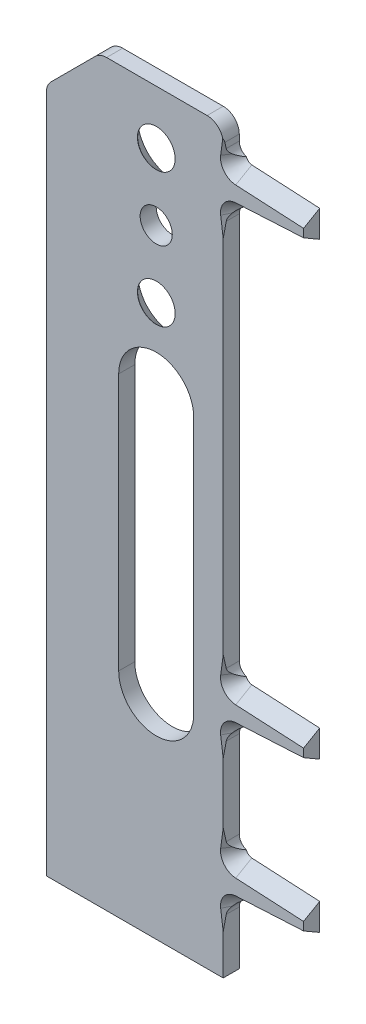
ISO-10303-21;
HEADER;
FILE_DESCRIPTION(('STEP AP214'),'2;1');
FILE_NAME('part.step','',(''),(''),'','','');
FILE_SCHEMA(('AUTOMOTIVE_DESIGN { 1 0 10303 214 1 1 1 1 }'));
ENDSEC;
DATA;
#1=APPLICATION_CONTEXT('core data for automotive mechanical design processes');
#2=APPLICATION_PROTOCOL_DEFINITION('international standard','automotive_design',2000,#1);
#3=PRODUCT_CONTEXT('',#1,'mechanical');
#4=PRODUCT('Part','Part','',(#3));
#5=PRODUCT_RELATED_PRODUCT_CATEGORY('part','',(#4));
#6=PRODUCT_DEFINITION_FORMATION('','',#4);
#7=PRODUCT_DEFINITION_CONTEXT('part definition',#1,'design');
#8=PRODUCT_DEFINITION('design','',#6,#7);
#9=PRODUCT_DEFINITION_SHAPE('','',#8);
#10=(LENGTH_UNIT() NAMED_UNIT(*) SI_UNIT(.MILLI.,.METRE.));
#11=(NAMED_UNIT(*) PLANE_ANGLE_UNIT() SI_UNIT($,.RADIAN.));
#12=(NAMED_UNIT(*) SI_UNIT($,.STERADIAN.) SOLID_ANGLE_UNIT());
#13=UNCERTAINTY_MEASURE_WITH_UNIT(LENGTH_MEASURE(1.E-05),#10,'distance_accuracy_value','');
#14=(GEOMETRIC_REPRESENTATION_CONTEXT(3) GLOBAL_UNCERTAINTY_ASSIGNED_CONTEXT((#13)) GLOBAL_UNIT_ASSIGNED_CONTEXT((#10,
#11,#12)) REPRESENTATION_CONTEXT('',''));
#15=CARTESIAN_POINT('',(0.,0.,0.));
#16=DIRECTION('',(0.,0.,1.));
#17=DIRECTION('',(1.,0.,0.));
#18=AXIS2_PLACEMENT_3D('',#15,#16,#17);
#19=CARTESIAN_POINT('',(15.1270310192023,-49.8773716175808,3.));
#20=DIRECTION('',(0.,0.,1.));
#21=DIRECTION('',(1.,0.,0.));
#22=AXIS2_PLACEMENT_3D('',#19,#20,#21);
#23=PLANE('',#22);
#24=CARTESIAN_POINT('',(0.627031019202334,40.,3.));
#25=DIRECTION('',(0.,0.,1.));
#26=DIRECTION('',(1.,0.,0.));
#27=AXIS2_PLACEMENT_3D('',#24,#25,#26);
#28=CIRCLE('',#27,3.50000000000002);
#29=CARTESIAN_POINT('',(0.647031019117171,43.4999428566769,3.));
#30=VERTEX_POINT('',#29);
#31=CARTESIAN_POINT('',(0.647031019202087,36.5000571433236,3.));
#32=VERTEX_POINT('',#31);
#33=EDGE_CURVE('E374',#30,#32,#28,.T.);
#34=ORIENTED_EDGE('',*,*,#33,.F.);
#35=CARTESIAN_POINT('',(0.667031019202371,40.,3.));
#36=DIRECTION('',(0.,0.,-1.));
#37=DIRECTION('',(-1.,0.,0.));
#38=AXIS2_PLACEMENT_3D('',#35,#36,#37);
#39=CIRCLE('',#38,3.50000000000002);
#40=EDGE_CURVE('E58',#30,#32,#39,.T.);
#41=ORIENTED_EDGE('',*,*,#40,.T.);
#42=EDGE_LOOP('',(#34,#41));
#43=FACE_BOUND('',#42,.T.);
#44=DIRECTION('',(0.132746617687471,-0.991150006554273,0.));
#45=VECTOR('',#44,1.);
#46=CARTESIAN_POINT('',(12.6529604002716,35.1632633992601,3.));
#47=LINE('',#46,#45);
#48=CARTESIAN_POINT('',(12.6529604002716,35.1632633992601,3.));
#49=VERTEX_POINT('',#48);
#50=CARTESIAN_POINT('',(13.1270310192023,31.6236244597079,3.));
#51=VERTEX_POINT('',#50);
#52=EDGE_CURVE('E885',#49,#51,#47,.T.);
#53=ORIENTED_EDGE('',*,*,#52,.F.);
#54=CARTESIAN_POINT('',(15.6264104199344,35.5615032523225,3.));
#55=DIRECTION('',(0.,0.,1.));
#56=DIRECTION('',(1.,0.,0.));
#57=AXIS2_PLACEMENT_3D('',#54,#55,#56);
#58=CIRCLE('',#57,3.);
#59=CARTESIAN_POINT('',(15.4669476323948,38.5572621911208,3.));
#60=VERTEX_POINT('',#59);
#61=EDGE_CURVE('E889',#60,#49,#58,.T.);
#62=ORIENTED_EDGE('',*,*,#61,.F.);
#63=DIRECTION('',(0.998586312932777,0.0531542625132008,0.));
#64=VECTOR('',#63,1.);
#65=CARTESIAN_POINT('',(15.4669476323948,38.5572621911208,3.));
#66=LINE('',#65,#64);
#67=CARTESIAN_POINT('',(28.1270310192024,39.2311522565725,3.));
#68=VERTEX_POINT('',#67);
#69=EDGE_CURVE('E903',#60,#68,#66,.T.);
#70=ORIENTED_EDGE('',*,*,#69,.T.);
#71=DIRECTION('',(0.,1.,0.));
#72=VECTOR('',#71,1.);
#73=CARTESIAN_POINT('',(28.1270310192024,42.5,3.));
#74=LINE('',#73,#72);
#75=CARTESIAN_POINT('',(28.1270310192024,40.7679491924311,3.));
#76=VERTEX_POINT('',#75);
#77=EDGE_CURVE('E478',#68,#76,#74,.T.);
#78=ORIENTED_EDGE('',*,*,#77,.T.);
#79=DIRECTION('',(0.998586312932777,-0.0531542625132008,0.));
#80=VECTOR('',#79,1.);
#81=CARTESIAN_POINT('',(15.4669476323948,41.4418392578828,3.));
#82=LINE('',#81,#80);
#83=CARTESIAN_POINT('',(15.4669476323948,41.4418392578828,3.));
#84=VERTEX_POINT('',#83);
#85=EDGE_CURVE('E840',#84,#76,#82,.T.);
#86=ORIENTED_EDGE('',*,*,#85,.F.);
#87=CARTESIAN_POINT('',(15.6264104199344,44.4375981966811,3.));
#88=DIRECTION('',(0.,0.,-1.));
#89=DIRECTION('',(-1.,0.,0.));
#90=AXIS2_PLACEMENT_3D('',#87,#88,#89);
#91=CIRCLE('',#90,3.);
#92=CARTESIAN_POINT('',(12.6529604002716,44.8358380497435,3.));
#93=VERTEX_POINT('',#92);
#94=EDGE_CURVE('E848',#84,#93,#91,.T.);
#95=ORIENTED_EDGE('',*,*,#94,.T.);
#96=DIRECTION('',(0.132746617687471,0.991150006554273,0.));
#97=VECTOR('',#96,1.);
#98=CARTESIAN_POINT('',(12.6529604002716,44.8358380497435,3.));
#99=LINE('',#98,#97);
#100=CARTESIAN_POINT('',(13.0392796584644,47.7202831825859,3.));
#101=VERTEX_POINT('',#100);
#102=EDGE_CURVE('E851',#93,#101,#99,.T.);
#103=ORIENTED_EDGE('',*,*,#102,.T.);
#104=CARTESIAN_POINT('',(10.1270310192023,47.,3.));
#105=DIRECTION('',(0.,0.,1.));
#106=DIRECTION('',(1.,0.,0.));
#107=AXIS2_PLACEMENT_3D('',#104,#105,#106);
#108=CIRCLE('',#107,3.);
#109=CARTESIAN_POINT('',(10.1270310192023,50.,3.));
#110=VERTEX_POINT('',#109);
#111=EDGE_CURVE('E480',#101,#110,#108,.T.);
#112=ORIENTED_EDGE('',*,*,#111,.T.);
#113=DIRECTION('',(-1.,0.,0.));
#114=VECTOR('',#113,1.);
#115=CARTESIAN_POINT('',(10.1270310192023,50.,3.));
#116=LINE('',#115,#114);
#117=CARTESIAN_POINT('',(-8.63032829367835,50.,3.));
#118=VERTEX_POINT('',#117);
#119=EDGE_CURVE('E482',#110,#118,#116,.T.);
#120=ORIENTED_EDGE('',*,*,#119,.T.);
#121=CARTESIAN_POINT('',(-8.63032829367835,47.,3.));
#122=DIRECTION('',(0.,0.,1.));
#123=DIRECTION('',(1.,0.,0.));
#124=AXIS2_PLACEMENT_3D('',#121,#122,#123);
#125=CIRCLE('',#124,3.00000000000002);
#126=CARTESIAN_POINT('',(-10.751648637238,49.1213203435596,3.));
#127=VERTEX_POINT('',#126);
#128=EDGE_CURVE('E484',#118,#127,#125,.T.);
#129=ORIENTED_EDGE('',*,*,#128,.T.);
#130=DIRECTION('',(-0.707106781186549,-0.707106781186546,0.));
#131=VECTOR('',#130,1.);
#132=CARTESIAN_POINT('',(-10.751648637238,49.1213203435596,3.));
#133=LINE('',#132,#131);
#134=CARTESIAN_POINT('',(-18.9942893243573,40.8786796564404,3.));
#135=VERTEX_POINT('',#134);
#136=EDGE_CURVE('E486',#127,#135,#133,.T.);
#137=ORIENTED_EDGE('',*,*,#136,.T.);
#138=CARTESIAN_POINT('',(-16.8729689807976,38.7573593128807,3.));
#139=DIRECTION('',(0.,0.,1.));
#140=DIRECTION('',(1.,0.,0.));
#141=AXIS2_PLACEMENT_3D('',#138,#139,#140);
#142=CIRCLE('',#141,3.00000000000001);
#143=CARTESIAN_POINT('',(-19.8729689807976,38.7573593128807,3.));
#144=VERTEX_POINT('',#143);
#145=EDGE_CURVE('E488',#135,#144,#142,.T.);
#146=ORIENTED_EDGE('',*,*,#145,.T.);
#147=DIRECTION('',(0.,-1.,0.));
#148=VECTOR('',#147,1.);
#149=CARTESIAN_POINT('',(-19.8729689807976,38.7573593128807,3.));
#150=LINE('',#149,#148);
#151=CARTESIAN_POINT('',(-19.8729689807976,-87.8704492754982,3.));
#152=VERTEX_POINT('',#151);
#153=EDGE_CURVE('E490',#144,#152,#150,.T.);
#154=ORIENTED_EDGE('',*,*,#153,.T.);
#155=DIRECTION('',(1.,0.,0.));
#156=VECTOR('',#155,1.);
#157=CARTESIAN_POINT('',(-19.8729689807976,-87.8704492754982,3.));
#158=LINE('',#157,#156);
#159=CARTESIAN_POINT('',(13.1270310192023,-87.8704492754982,3.));
#160=VERTEX_POINT('',#159);
#161=EDGE_CURVE('E492',#152,#160,#158,.T.);
#162=ORIENTED_EDGE('',*,*,#161,.T.);
#163=DIRECTION('',(0.,1.,0.));
#164=VECTOR('',#163,1.);
#165=CARTESIAN_POINT('',(13.1270310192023,-77.8773716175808,3.));
#166=LINE('',#165,#164);
#167=CARTESIAN_POINT('',(13.1270310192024,-80.3763755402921,3.));
#168=VERTEX_POINT('',#167);
#169=EDGE_CURVE('E494',#160,#168,#166,.T.);
#170=ORIENTED_EDGE('',*,*,#169,.T.);
#171=DIRECTION('',(0.132746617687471,-0.991150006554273,0.));
#172=VECTOR('',#171,1.);
#173=CARTESIAN_POINT('',(12.6529604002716,-76.8367366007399,3.));
#174=LINE('',#173,#172);
#175=CARTESIAN_POINT('',(12.6529604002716,-76.8367366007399,3.));
#176=VERTEX_POINT('',#175);
#177=EDGE_CURVE('E648',#176,#168,#174,.T.);
#178=ORIENTED_EDGE('',*,*,#177,.F.);
#179=CARTESIAN_POINT('',(15.6264104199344,-76.4384967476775,3.));
#180=DIRECTION('',(0.,0.,1.));
#181=DIRECTION('',(1.,0.,0.));
#182=AXIS2_PLACEMENT_3D('',#179,#180,#181);
#183=CIRCLE('',#182,3.);
#184=CARTESIAN_POINT('',(15.4669476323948,-73.4427378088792,3.));
#185=VERTEX_POINT('',#184);
#186=EDGE_CURVE('E652',#185,#176,#183,.T.);
#187=ORIENTED_EDGE('',*,*,#186,.F.);
#188=DIRECTION('',(0.998586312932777,0.0531542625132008,0.));
#189=VECTOR('',#188,1.);
#190=CARTESIAN_POINT('',(15.4669476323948,-73.4427378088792,3.));
#191=LINE('',#190,#189);
#192=CARTESIAN_POINT('',(28.1270310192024,-72.7688477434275,3.));
#193=VERTEX_POINT('',#192);
#194=EDGE_CURVE('E665',#185,#193,#191,.T.);
#195=ORIENTED_EDGE('',*,*,#194,.T.);
#196=DIRECTION('',(0.,1.,0.));
#197=VECTOR('',#196,1.);
#198=CARTESIAN_POINT('',(28.1270310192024,-69.5,3.));
#199=LINE('',#198,#197);
#200=CARTESIAN_POINT('',(28.1270310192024,-71.2320508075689,3.));
#201=VERTEX_POINT('',#200);
#202=EDGE_CURVE('E497',#193,#201,#199,.T.);
#203=ORIENTED_EDGE('',*,*,#202,.T.);
#204=DIRECTION('',(0.998586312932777,-0.0531542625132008,0.));
#205=VECTOR('',#204,1.);
#206=CARTESIAN_POINT('',(15.4669476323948,-70.5581607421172,3.));
#207=LINE('',#206,#205);
#208=CARTESIAN_POINT('',(15.4669476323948,-70.5581607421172,3.));
#209=VERTEX_POINT('',#208);
#210=EDGE_CURVE('E585',#209,#201,#207,.T.);
#211=ORIENTED_EDGE('',*,*,#210,.F.);
#212=CARTESIAN_POINT('',(15.6264104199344,-67.5624018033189,3.));
#213=DIRECTION('',(0.,0.,-1.));
#214=DIRECTION('',(-1.,0.,0.));
#215=AXIS2_PLACEMENT_3D('',#212,#213,#214);
#216=CIRCLE('',#215,3.);
#217=CARTESIAN_POINT('',(12.6529604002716,-67.1641619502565,3.));
#218=VERTEX_POINT('',#217);
#219=EDGE_CURVE('E593',#209,#218,#216,.T.);
#220=ORIENTED_EDGE('',*,*,#219,.T.);
#221=DIRECTION('',(0.132746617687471,0.991150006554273,0.));
#222=VECTOR('',#221,1.);
#223=CARTESIAN_POINT('',(12.6529604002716,-67.1641619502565,3.));
#224=LINE('',#223,#222);
#225=CARTESIAN_POINT('',(13.1270310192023,-63.6245230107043,3.));
#226=VERTEX_POINT('',#225);
#227=EDGE_CURVE('E596',#218,#226,#224,.T.);
#228=ORIENTED_EDGE('',*,*,#227,.T.);
#229=DIRECTION('',(0.,1.,0.));
#230=VECTOR('',#229,1.);
#231=CARTESIAN_POINT('',(13.1270310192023,-49.8773716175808,3.));
#232=LINE('',#231,#230);
#233=CARTESIAN_POINT('',(13.1270310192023,-52.3763755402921,3.));
#234=VERTEX_POINT('',#233);
#235=EDGE_CURVE('E499',#226,#234,#232,.T.);
#236=ORIENTED_EDGE('',*,*,#235,.T.);
#237=DIRECTION('',(0.132746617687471,-0.991150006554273,0.));
#238=VECTOR('',#237,1.);
#239=CARTESIAN_POINT('',(12.6529604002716,-48.8367366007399,3.));
#240=LINE('',#239,#238);
#241=CARTESIAN_POINT('',(12.6529604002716,-48.8367366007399,3.));
#242=VERTEX_POINT('',#241);
#243=EDGE_CURVE('E768',#242,#234,#240,.T.);
#244=ORIENTED_EDGE('',*,*,#243,.F.);
#245=CARTESIAN_POINT('',(15.6264104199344,-48.4384967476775,3.));
#246=DIRECTION('',(0.,0.,1.));
#247=DIRECTION('',(1.,0.,0.));
#248=AXIS2_PLACEMENT_3D('',#245,#246,#247);
#249=CIRCLE('',#248,3.);
#250=CARTESIAN_POINT('',(15.4669476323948,-45.4427378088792,3.));
#251=VERTEX_POINT('',#250);
#252=EDGE_CURVE('E772',#251,#242,#249,.T.);
#253=ORIENTED_EDGE('',*,*,#252,.F.);
#254=DIRECTION('',(0.998586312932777,0.0531542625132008,0.));
#255=VECTOR('',#254,1.);
#256=CARTESIAN_POINT('',(15.4669476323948,-45.4427378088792,3.));
#257=LINE('',#256,#255);
#258=CARTESIAN_POINT('',(28.1270310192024,-44.7688477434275,3.));
#259=VERTEX_POINT('',#258);
#260=EDGE_CURVE('E782',#251,#259,#257,.T.);
#261=ORIENTED_EDGE('',*,*,#260,.T.);
#262=DIRECTION('',(0.,1.,0.));
#263=VECTOR('',#262,1.);
#264=CARTESIAN_POINT('',(28.1270310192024,-41.5,3.));
#265=LINE('',#264,#263);
#266=CARTESIAN_POINT('',(28.1270310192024,-43.2320508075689,3.));
#267=VERTEX_POINT('',#266);
#268=EDGE_CURVE('E473',#259,#267,#265,.T.);
#269=ORIENTED_EDGE('',*,*,#268,.T.);
#270=DIRECTION('',(0.998586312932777,-0.0531542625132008,0.));
#271=VECTOR('',#270,1.);
#272=CARTESIAN_POINT('',(15.4669476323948,-42.5581607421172,3.));
#273=LINE('',#272,#271);
#274=CARTESIAN_POINT('',(15.4669476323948,-42.5581607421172,3.));
#275=VERTEX_POINT('',#274);
#276=EDGE_CURVE('E725',#275,#267,#273,.T.);
#277=ORIENTED_EDGE('',*,*,#276,.F.);
#278=CARTESIAN_POINT('',(15.6264104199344,-39.5624018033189,3.));
#279=DIRECTION('',(0.,0.,-1.));
#280=DIRECTION('',(-1.,0.,0.));
#281=AXIS2_PLACEMENT_3D('',#278,#279,#280);
#282=CIRCLE('',#281,3.);
#283=CARTESIAN_POINT('',(12.6529604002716,-39.1641619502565,3.));
#284=VERTEX_POINT('',#283);
#285=EDGE_CURVE('E733',#275,#284,#282,.T.);
#286=ORIENTED_EDGE('',*,*,#285,.T.);
#287=DIRECTION('',(0.132746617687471,0.991150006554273,0.));
#288=VECTOR('',#287,1.);
#289=CARTESIAN_POINT('',(12.6529604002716,-39.1641619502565,3.));
#290=LINE('',#289,#288);
#291=CARTESIAN_POINT('',(13.1270310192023,-35.6245230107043,3.));
#292=VERTEX_POINT('',#291);
#293=EDGE_CURVE('E736',#284,#292,#290,.T.);
#294=ORIENTED_EDGE('',*,*,#293,.T.);
#295=DIRECTION('',(0.,1.,0.));
#296=VECTOR('',#295,1.);
#297=CARTESIAN_POINT('',(13.1270310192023,34.1226283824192,3.));
#298=LINE('',#297,#296);
#299=EDGE_CURVE('E475',#292,#51,#298,.T.);
#300=ORIENTED_EDGE('',*,*,#299,.T.);
#301=EDGE_LOOP('',(#53,#62,#70,#78,#86,#95,#103,#112,#120,#129,#137,#146,#154,#162,#170,#178,
#187,#195,#203,#211,#220,#228,#236,#244,#253,#261,#269,#277,#286,#294,#300));
#302=FACE_BOUND('',#301,.T.);
#303=DIRECTION('',(0.,1.,0.));
#304=VECTOR('',#303,1.);
#305=CARTESIAN_POINT('',(7.62703101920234,0.,3.));
#306=LINE('',#305,#304);
#307=CARTESIAN_POINT('',(7.62703101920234,-48.,3.));
#308=VERTEX_POINT('',#307);
#309=CARTESIAN_POINT('',(7.62703101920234,0.,3.));
#310=VERTEX_POINT('',#309);
#311=EDGE_CURVE('E391',#308,#310,#306,.T.);
#312=ORIENTED_EDGE('',*,*,#311,.F.);
#313=CARTESIAN_POINT('',(0.627031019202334,-48.,3.));
#314=DIRECTION('',(0.,0.,1.));
#315=DIRECTION('',(1.,0.,0.));
#316=AXIS2_PLACEMENT_3D('',#313,#314,#315);
#317=CIRCLE('',#316,7.00000000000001);
#318=CARTESIAN_POINT('',(-6.37296898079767,-48.,3.));
#319=VERTEX_POINT('',#318);
#320=EDGE_CURVE('E389',#319,#308,#317,.T.);
#321=ORIENTED_EDGE('',*,*,#320,.F.);
#322=DIRECTION('',(0.,-1.,0.));
#323=VECTOR('',#322,1.);
#324=CARTESIAN_POINT('',(-6.37296898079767,0.,3.));
#325=LINE('',#324,#323);
#326=CARTESIAN_POINT('',(-6.37296898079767,0.,3.));
#327=VERTEX_POINT('',#326);
#328=EDGE_CURVE('E396',#327,#319,#325,.T.);
#329=ORIENTED_EDGE('',*,*,#328,.F.);
#330=CARTESIAN_POINT('',(0.627031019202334,0.,3.));
#331=DIRECTION('',(0.,0.,1.));
#332=DIRECTION('',(1.,0.,0.));
#333=AXIS2_PLACEMENT_3D('',#330,#331,#332);
#334=CIRCLE('',#333,7.00000000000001);
#335=EDGE_CURVE('E393',#310,#327,#334,.T.);
#336=ORIENTED_EDGE('',*,*,#335,.F.);
#337=EDGE_LOOP('',(#312,#321,#329,#336));
#338=FACE_BOUND('',#337,.T.);
#339=CARTESIAN_POINT('',(0.627031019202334,27.5,3.));
#340=DIRECTION('',(0.,0.,1.));
#341=DIRECTION('',(1.,0.,0.));
#342=AXIS2_PLACEMENT_3D('',#339,#340,#341);
#343=CIRCLE('',#342,2.99999999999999);
#344=CARTESIAN_POINT('',(3.62703101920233,27.5,3.));
#345=VERTEX_POINT('',#344);
#346=EDGE_CURVE('E365',#345,#345,#343,.T.);
#347=ORIENTED_EDGE('',*,*,#346,.F.);
#348=EDGE_LOOP('',(#347));
#349=FACE_BOUND('',#348,.T.);
#350=CARTESIAN_POINT('',(0.627031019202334,15.,3.));
#351=DIRECTION('',(0.,0.,1.));
#352=DIRECTION('',(1.,0.,0.));
#353=AXIS2_PLACEMENT_3D('',#350,#351,#352);
#354=CIRCLE('',#353,3.50000000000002);
#355=CARTESIAN_POINT('',(0.647031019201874,18.4999428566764,3.));
#356=VERTEX_POINT('',#355);
#357=CARTESIAN_POINT('',(0.647031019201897,11.5000571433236,3.));
#358=VERTEX_POINT('',#357);
#359=EDGE_CURVE('E356',#356,#358,#354,.T.);
#360=ORIENTED_EDGE('',*,*,#359,.F.);
#361=CARTESIAN_POINT('',(0.667031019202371,15.,3.));
#362=DIRECTION('',(0.,0.,-1.));
#363=DIRECTION('',(-1.,0.,0.));
#364=AXIS2_PLACEMENT_3D('',#361,#362,#363);
#365=CIRCLE('',#364,3.50000000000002);
#366=EDGE_CURVE('E52',#356,#358,#365,.T.);
#367=ORIENTED_EDGE('',*,*,#366,.T.);
#368=EDGE_LOOP('',(#360,#367));
#369=FACE_BOUND('',#368,.T.);
#370=ADVANCED_FACE('F32',(#43,#302,#338,#349,#369),#23,.T.);
#371=CARTESIAN_POINT('',(15.1270310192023,-49.8773716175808,0.));
#372=DIRECTION('',(0.,0.,1.));
#373=DIRECTION('',(1.,0.,0.));
#374=AXIS2_PLACEMENT_3D('',#371,#372,#373);
#375=PLANE('',#374);
#376=CARTESIAN_POINT('',(0.667031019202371,40.,0.));
#377=DIRECTION('',(0.,0.,-1.));
#378=DIRECTION('',(-1.,0.,0.));
#379=AXIS2_PLACEMENT_3D('',#376,#377,#378);
#380=CIRCLE('',#379,6.5);
#381=CARTESIAN_POINT('',(-5.83296898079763,40.,0.));
#382=VERTEX_POINT('',#381);
#383=EDGE_CURVE('E357',#382,#382,#380,.T.);
#384=ORIENTED_EDGE('',*,*,#383,.F.);
#385=EDGE_LOOP('',(#384));
#386=FACE_BOUND('',#385,.T.);
#387=CARTESIAN_POINT('',(0.627031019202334,-48.,0.));
#388=DIRECTION('',(0.,0.,1.));
#389=DIRECTION('',(1.,0.,0.));
#390=AXIS2_PLACEMENT_3D('',#387,#388,#389);
#391=CIRCLE('',#390,7.00000000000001);
#392=CARTESIAN_POINT('',(-6.37296898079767,-48.,0.));
#393=VERTEX_POINT('',#392);
#394=CARTESIAN_POINT('',(7.62703101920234,-48.,0.));
#395=VERTEX_POINT('',#394);
#396=EDGE_CURVE('E377',#393,#395,#391,.T.);
#397=ORIENTED_EDGE('',*,*,#396,.T.);
#398=DIRECTION('',(0.,1.,0.));
#399=VECTOR('',#398,1.);
#400=CARTESIAN_POINT('',(7.62703101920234,0.,0.));
#401=LINE('',#400,#399);
#402=CARTESIAN_POINT('',(7.62703101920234,0.,0.));
#403=VERTEX_POINT('',#402);
#404=EDGE_CURVE('E380',#395,#403,#401,.T.);
#405=ORIENTED_EDGE('',*,*,#404,.T.);
#406=CARTESIAN_POINT('',(0.627031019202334,0.,0.));
#407=DIRECTION('',(0.,0.,1.));
#408=DIRECTION('',(1.,0.,0.));
#409=AXIS2_PLACEMENT_3D('',#406,#407,#408);
#410=CIRCLE('',#409,7.00000000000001);
#411=CARTESIAN_POINT('',(-6.37296898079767,0.,0.));
#412=VERTEX_POINT('',#411);
#413=EDGE_CURVE('E383',#403,#412,#410,.T.);
#414=ORIENTED_EDGE('',*,*,#413,.T.);
#415=DIRECTION('',(0.,-1.,0.));
#416=VECTOR('',#415,1.);
#417=CARTESIAN_POINT('',(-6.37296898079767,0.,0.));
#418=LINE('',#417,#416);
#419=EDGE_CURVE('E386',#412,#393,#418,.T.);
#420=ORIENTED_EDGE('',*,*,#419,.T.);
#421=EDGE_LOOP('',(#397,#405,#414,#420));
#422=FACE_BOUND('',#421,.T.);
#423=CARTESIAN_POINT('',(0.627031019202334,27.5,0.));
#424=DIRECTION('',(0.,0.,1.));
#425=DIRECTION('',(1.,0.,0.));
#426=AXIS2_PLACEMENT_3D('',#423,#424,#425);
#427=CIRCLE('',#426,2.99999999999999);
#428=CARTESIAN_POINT('',(3.62703101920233,27.5,0.));
#429=VERTEX_POINT('',#428);
#430=EDGE_CURVE('E361',#429,#429,#427,.T.);
#431=ORIENTED_EDGE('',*,*,#430,.T.);
#432=EDGE_LOOP('',(#431));
#433=FACE_BOUND('',#432,.T.);
#434=DIRECTION('',(0.998586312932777,0.0531542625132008,0.));
#435=VECTOR('',#434,1.);
#436=CARTESIAN_POINT('',(10.526549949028,36.5498914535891,0.));
#437=LINE('',#436,#435);
#438=CARTESIAN_POINT('',(15.4669476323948,36.8128664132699,0.));
#439=VERTEX_POINT('',#438);
#440=CARTESIAN_POINT('',(27.8717328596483,37.4731670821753,0.));
#441=VERTEX_POINT('',#440);
#442=EDGE_CURVE('E879',#439,#441,#437,.T.);
#443=ORIENTED_EDGE('',*,*,#442,.F.);
#444=CARTESIAN_POINT('',(15.6264104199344,35.5615032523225,0.));
#445=DIRECTION('',(0.,0.,1.));
#446=DIRECTION('',(1.,0.,0.));
#447=AXIS2_PLACEMENT_3D('',#444,#445,#446);
#448=CIRCLE('',#447,1.26148251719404);
#449=CARTESIAN_POINT('',(14.4445524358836,36.0025813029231,0.));
#450=VERTEX_POINT('',#449);
#451=EDGE_CURVE('E887',#439,#450,#448,.T.);
#452=ORIENTED_EDGE('',*,*,#451,.T.);
#453=CARTESIAN_POINT('',(15.1270310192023,34.1226283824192,0.));
#454=DIRECTION('',(0.,0.,-1.));
#455=DIRECTION('',(1.,0.,0.));
#456=AXIS2_PLACEMENT_3D('',#453,#454,#455);
#457=CIRCLE('',#456,2.);
#458=CARTESIAN_POINT('',(13.1270310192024,34.1226283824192,0.));
#459=VERTEX_POINT('',#458);
#460=EDGE_CURVE('E424',#459,#450,#457,.T.);
#461=ORIENTED_EDGE('',*,*,#460,.F.);
#462=DIRECTION('',(0.,1.,0.));
#463=VECTOR('',#462,1.);
#464=CARTESIAN_POINT('',(13.1270310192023,34.1226283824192,0.));
#465=LINE('',#464,#463);
#466=CARTESIAN_POINT('',(13.1270310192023,-38.1226283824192,0.));
#467=VERTEX_POINT('',#466);
#468=EDGE_CURVE('E421',#467,#459,#465,.T.);
#469=ORIENTED_EDGE('',*,*,#468,.F.);
#470=CARTESIAN_POINT('',(15.1270310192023,-38.1226283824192,0.));
#471=DIRECTION('',(0.,0.,-1.));
#472=DIRECTION('',(1.,0.,0.));
#473=AXIS2_PLACEMENT_3D('',#470,#471,#472);
#474=CIRCLE('',#473,2.00000000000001);
#475=CARTESIAN_POINT('',(14.4441651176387,-40.0024406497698,0.));
#476=VERTEX_POINT('',#475);
#477=EDGE_CURVE('E419',#476,#467,#474,.T.);
#478=ORIENTED_EDGE('',*,*,#477,.F.);
#479=CARTESIAN_POINT('',(15.6264104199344,-39.5624018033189,0.));
#480=DIRECTION('',(0.,0.,-1.));
#481=DIRECTION('',(-1.,0.,0.));
#482=AXIS2_PLACEMENT_3D('',#479,#480,#481);
#483=CIRCLE('',#482,1.26148251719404);
#484=CARTESIAN_POINT('',(15.4669476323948,-40.8137649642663,0.));
#485=VERTEX_POINT('',#484);
#486=EDGE_CURVE('E741',#485,#476,#483,.T.);
#487=ORIENTED_EDGE('',*,*,#486,.F.);
#488=DIRECTION('',(0.998586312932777,-0.0531542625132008,0.));
#489=VECTOR('',#488,1.);
#490=CARTESIAN_POINT('',(15.6090796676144,-40.8213305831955,0.));
#491=LINE('',#490,#489);
#492=CARTESIAN_POINT('',(27.8890544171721,-41.4749876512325,0.));
#493=VERTEX_POINT('',#492);
#494=EDGE_CURVE('E743',#485,#493,#491,.T.);
#495=ORIENTED_EDGE('',*,*,#494,.T.);
#496=DIRECTION('',(-0.994521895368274,0.104528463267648,0.));
#497=VECTOR('',#496,1.);
#498=CARTESIAN_POINT('',(28.1270310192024,-41.5,0.));
#499=LINE('',#498,#497);
#500=CARTESIAN_POINT('',(28.1270310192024,-41.5,0.));
#501=VERTEX_POINT('',#500);
#502=EDGE_CURVE('E416',#501,#493,#499,.T.);
#503=ORIENTED_EDGE('',*,*,#502,.F.);
#504=DIRECTION('',(0.,1.,0.));
#505=VECTOR('',#504,1.);
#506=CARTESIAN_POINT('',(28.1270310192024,-41.5,0.));
#507=LINE('',#506,#505);
#508=CARTESIAN_POINT('',(28.1270310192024,-46.5,0.));
#509=VERTEX_POINT('',#508);
#510=EDGE_CURVE('E413',#509,#501,#507,.T.);
#511=ORIENTED_EDGE('',*,*,#510,.F.);
#512=DIRECTION('',(0.994521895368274,0.10452846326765,0.));
#513=VECTOR('',#512,1.);
#514=CARTESIAN_POINT('',(28.1270310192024,-46.5,0.));
#515=LINE('',#514,#513);
#516=CARTESIAN_POINT('',(27.871732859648,-46.5268329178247,0.));
#517=VERTEX_POINT('',#516);
#518=EDGE_CURVE('E411',#517,#509,#515,.T.);
#519=ORIENTED_EDGE('',*,*,#518,.F.);
#520=DIRECTION('',(0.998586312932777,0.0531542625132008,0.));
#521=VECTOR('',#520,1.);
#522=CARTESIAN_POINT('',(14.9851959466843,-47.2127769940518,0.));
#523=LINE('',#522,#521);
#524=CARTESIAN_POINT('',(15.4669476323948,-47.1871335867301,0.));
#525=VERTEX_POINT('',#524);
#526=EDGE_CURVE('E762',#525,#517,#523,.T.);
#527=ORIENTED_EDGE('',*,*,#526,.F.);
#528=CARTESIAN_POINT('',(15.6264104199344,-48.4384967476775,0.));
#529=DIRECTION('',(0.,0.,1.));
#530=DIRECTION('',(1.,0.,0.));
#531=AXIS2_PLACEMENT_3D('',#528,#529,#530);
#532=CIRCLE('',#531,1.26148251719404);
#533=CARTESIAN_POINT('',(14.4445524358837,-47.9974186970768,0.));
#534=VERTEX_POINT('',#533);
#535=EDGE_CURVE('E770',#525,#534,#532,.T.);
#536=ORIENTED_EDGE('',*,*,#535,.T.);
#537=CARTESIAN_POINT('',(15.1270310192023,-49.8773716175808,0.));
#538=DIRECTION('',(0.,0.,-1.));
#539=DIRECTION('',(1.,0.,0.));
#540=AXIS2_PLACEMENT_3D('',#537,#538,#539);
#541=CIRCLE('',#540,2.);
#542=CARTESIAN_POINT('',(13.1270310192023,-49.8773716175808,0.));
#543=VERTEX_POINT('',#542);
#544=EDGE_CURVE('E408',#543,#534,#541,.T.);
#545=ORIENTED_EDGE('',*,*,#544,.F.);
#546=DIRECTION('',(0.,1.,0.));
#547=VECTOR('',#546,1.);
#548=CARTESIAN_POINT('',(13.1270310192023,-49.8773716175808,0.));
#549=LINE('',#548,#547);
#550=CARTESIAN_POINT('',(13.1270310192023,-66.1226283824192,0.));
#551=VERTEX_POINT('',#550);
#552=EDGE_CURVE('E470',#551,#543,#549,.T.);
#553=ORIENTED_EDGE('',*,*,#552,.F.);
#554=CARTESIAN_POINT('',(15.1270310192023,-66.1226283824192,0.));
#555=DIRECTION('',(0.,0.,-1.));
#556=DIRECTION('',(1.,0.,0.));
#557=AXIS2_PLACEMENT_3D('',#554,#555,#556);
#558=CIRCLE('',#557,2.00000000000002);
#559=CARTESIAN_POINT('',(14.4441651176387,-68.0024406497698,0.));
#560=VERTEX_POINT('',#559);
#561=EDGE_CURVE('E468',#560,#551,#558,.T.);
#562=ORIENTED_EDGE('',*,*,#561,.F.);
#563=CARTESIAN_POINT('',(15.6264104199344,-67.5624018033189,0.));
#564=DIRECTION('',(0.,0.,-1.));
#565=DIRECTION('',(-1.,0.,0.));
#566=AXIS2_PLACEMENT_3D('',#563,#564,#565);
#567=CIRCLE('',#566,1.26148251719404);
#568=CARTESIAN_POINT('',(15.4669476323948,-68.8137649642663,0.));
#569=VERTEX_POINT('',#568);
#570=EDGE_CURVE('E368',#569,#560,#567,.T.);
#571=ORIENTED_EDGE('',*,*,#570,.F.);
#572=DIRECTION('',(0.998586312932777,-0.0531542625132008,0.));
#573=VECTOR('',#572,1.);
#574=CARTESIAN_POINT('',(14.1228643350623,-68.7422200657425,0.));
#575=LINE('',#574,#573);
#576=CARTESIAN_POINT('',(27.889054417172,-69.4749876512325,0.));
#577=VERTEX_POINT('',#576);
#578=EDGE_CURVE('E362',#569,#577,#575,.T.);
#579=ORIENTED_EDGE('',*,*,#578,.T.);
#580=DIRECTION('',(-0.994521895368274,0.104528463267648,0.));
#581=VECTOR('',#580,1.);
#582=CARTESIAN_POINT('',(28.1270310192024,-69.5,0.));
#583=LINE('',#582,#581);
#584=CARTESIAN_POINT('',(28.1270310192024,-69.5,0.));
#585=VERTEX_POINT('',#584);
#586=EDGE_CURVE('E465',#585,#577,#583,.T.);
#587=ORIENTED_EDGE('',*,*,#586,.F.);
#588=DIRECTION('',(0.,1.,0.));
#589=VECTOR('',#588,1.);
#590=CARTESIAN_POINT('',(28.1270310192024,-69.5,0.));
#591=LINE('',#590,#589);
#592=CARTESIAN_POINT('',(28.1270310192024,-74.5,0.));
#593=VERTEX_POINT('',#592);
#594=EDGE_CURVE('E462',#593,#585,#591,.T.);
#595=ORIENTED_EDGE('',*,*,#594,.F.);
#596=DIRECTION('',(0.994521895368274,0.104528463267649,0.));
#597=VECTOR('',#596,1.);
#598=CARTESIAN_POINT('',(28.1270310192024,-74.5,0.));
#599=LINE('',#598,#597);
#600=CARTESIAN_POINT('',(27.8717328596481,-74.5268329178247,0.));
#601=VERTEX_POINT('',#600);
#602=EDGE_CURVE('E460',#601,#593,#599,.T.);
#603=ORIENTED_EDGE('',*,*,#602,.F.);
#604=DIRECTION('',(0.998586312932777,0.0531542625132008,0.));
#605=VECTOR('',#604,1.);
#606=CARTESIAN_POINT('',(16.4714112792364,-75.1336664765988,0.));
#607=LINE('',#606,#605);
#608=CARTESIAN_POINT('',(15.4669476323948,-75.1871335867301,0.));
#609=VERTEX_POINT('',#608);
#610=EDGE_CURVE('E642',#609,#601,#607,.T.);
#611=ORIENTED_EDGE('',*,*,#610,.F.);
#612=CARTESIAN_POINT('',(15.6264104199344,-76.4384967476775,0.));
#613=DIRECTION('',(0.,0.,1.));
#614=DIRECTION('',(1.,0.,0.));
#615=AXIS2_PLACEMENT_3D('',#612,#613,#614);
#616=CIRCLE('',#615,1.26148251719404);
#617=CARTESIAN_POINT('',(14.4445524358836,-75.9974186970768,0.));
#618=VERTEX_POINT('',#617);
#619=EDGE_CURVE('E650',#609,#618,#616,.T.);
#620=ORIENTED_EDGE('',*,*,#619,.T.);
#621=CARTESIAN_POINT('',(15.1270310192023,-77.8773716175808,0.));
#622=DIRECTION('',(0.,0.,-1.));
#623=DIRECTION('',(1.,0.,0.));
#624=AXIS2_PLACEMENT_3D('',#621,#622,#623);
#625=CIRCLE('',#624,2.);
#626=CARTESIAN_POINT('',(13.1270310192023,-77.8773716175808,0.));
#627=VERTEX_POINT('',#626);
#628=EDGE_CURVE('E457',#627,#618,#625,.T.);
#629=ORIENTED_EDGE('',*,*,#628,.F.);
#630=DIRECTION('',(0.,1.,0.));
#631=VECTOR('',#630,1.);
#632=CARTESIAN_POINT('',(13.1270310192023,-77.8773716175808,0.));
#633=LINE('',#632,#631);
#634=CARTESIAN_POINT('',(13.1270310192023,-87.8704492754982,0.));
#635=VERTEX_POINT('',#634);
#636=EDGE_CURVE('E454',#635,#627,#633,.T.);
#637=ORIENTED_EDGE('',*,*,#636,.F.);
#638=DIRECTION('',(1.,0.,0.));
#639=VECTOR('',#638,1.);
#640=CARTESIAN_POINT('',(-19.8729689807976,-87.8704492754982,0.));
#641=LINE('',#640,#639);
#642=CARTESIAN_POINT('',(-19.8729689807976,-87.8704492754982,0.));
#643=VERTEX_POINT('',#642);
#644=EDGE_CURVE('E452',#643,#635,#641,.T.);
#645=ORIENTED_EDGE('',*,*,#644,.F.);
#646=DIRECTION('',(0.,-1.,0.));
#647=VECTOR('',#646,1.);
#648=CARTESIAN_POINT('',(-19.8729689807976,38.7573593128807,0.));
#649=LINE('',#648,#647);
#650=CARTESIAN_POINT('',(-19.8729689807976,38.7573593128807,0.));
#651=VERTEX_POINT('',#650);
#652=EDGE_CURVE('E450',#651,#643,#649,.T.);
#653=ORIENTED_EDGE('',*,*,#652,.F.);
#654=CARTESIAN_POINT('',(-16.8729689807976,38.7573593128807,0.));
#655=DIRECTION('',(0.,0.,1.));
#656=DIRECTION('',(1.,0.,0.));
#657=AXIS2_PLACEMENT_3D('',#654,#655,#656);
#658=CIRCLE('',#657,3.00000000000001);
#659=CARTESIAN_POINT('',(-18.9942893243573,40.8786796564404,0.));
#660=VERTEX_POINT('',#659);
#661=EDGE_CURVE('E448',#660,#651,#658,.T.);
#662=ORIENTED_EDGE('',*,*,#661,.F.);
#663=DIRECTION('',(-0.707106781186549,-0.707106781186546,0.));
#664=VECTOR('',#663,1.);
#665=CARTESIAN_POINT('',(-10.751648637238,49.1213203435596,0.));
#666=LINE('',#665,#664);
#667=CARTESIAN_POINT('',(-10.751648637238,49.1213203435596,0.));
#668=VERTEX_POINT('',#667);
#669=EDGE_CURVE('E446',#668,#660,#666,.T.);
#670=ORIENTED_EDGE('',*,*,#669,.F.);
#671=CARTESIAN_POINT('',(-8.63032829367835,47.,0.));
#672=DIRECTION('',(0.,0.,1.));
#673=DIRECTION('',(1.,0.,0.));
#674=AXIS2_PLACEMENT_3D('',#671,#672,#673);
#675=CIRCLE('',#674,3.00000000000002);
#676=CARTESIAN_POINT('',(-8.63032829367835,50.,0.));
#677=VERTEX_POINT('',#676);
#678=EDGE_CURVE('E444',#677,#668,#675,.T.);
#679=ORIENTED_EDGE('',*,*,#678,.F.);
#680=DIRECTION('',(-1.,0.,0.));
#681=VECTOR('',#680,1.);
#682=CARTESIAN_POINT('',(10.1270310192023,50.,0.));
#683=LINE('',#682,#681);
#684=CARTESIAN_POINT('',(10.1270310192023,50.,0.));
#685=VERTEX_POINT('',#684);
#686=EDGE_CURVE('E442',#685,#677,#683,.T.);
#687=ORIENTED_EDGE('',*,*,#686,.F.);
#688=CARTESIAN_POINT('',(10.1270310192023,47.,0.));
#689=DIRECTION('',(0.,0.,1.));
#690=DIRECTION('',(1.,0.,0.));
#691=AXIS2_PLACEMENT_3D('',#688,#689,#690);
#692=CIRCLE('',#691,3.);
#693=CARTESIAN_POINT('',(13.1270310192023,47.,0.));
#694=VERTEX_POINT('',#693);
#695=EDGE_CURVE('E440',#694,#685,#692,.T.);
#696=ORIENTED_EDGE('',*,*,#695,.F.);
#697=DIRECTION('',(0.,1.,0.));
#698=VECTOR('',#697,1.);
#699=CARTESIAN_POINT('',(13.1270310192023,47.,0.));
#700=LINE('',#699,#698);
#701=CARTESIAN_POINT('',(13.1270310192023,45.8773716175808,0.));
#702=VERTEX_POINT('',#701);
#703=EDGE_CURVE('E437',#702,#694,#700,.T.);
#704=ORIENTED_EDGE('',*,*,#703,.F.);
#705=CARTESIAN_POINT('',(15.1270310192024,45.8773716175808,0.));
#706=DIRECTION('',(0.,0.,-1.));
#707=DIRECTION('',(1.,0.,0.));
#708=AXIS2_PLACEMENT_3D('',#705,#706,#707);
#709=CIRCLE('',#708,2.00000000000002);
#710=CARTESIAN_POINT('',(14.4441651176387,43.9975593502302,0.));
#711=VERTEX_POINT('',#710);
#712=EDGE_CURVE('E435',#711,#702,#709,.T.);
#713=ORIENTED_EDGE('',*,*,#712,.F.);
#714=CARTESIAN_POINT('',(15.6264104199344,44.4375981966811,0.));
#715=DIRECTION('',(0.,0.,-1.));
#716=DIRECTION('',(-1.,0.,0.));
#717=AXIS2_PLACEMENT_3D('',#714,#715,#716);
#718=CIRCLE('',#717,1.26148251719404);
#719=CARTESIAN_POINT('',(15.4669476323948,43.1862350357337,0.));
#720=VERTEX_POINT('',#719);
#721=EDGE_CURVE('E858',#720,#711,#718,.T.);
#722=ORIENTED_EDGE('',*,*,#721,.F.);
#723=DIRECTION('',(0.998586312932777,-0.0531542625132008,0.));
#724=VECTOR('',#723,1.);
#725=CARTESIAN_POINT('',(20.0677256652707,42.9413378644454,0.));
#726=LINE('',#725,#724);
#727=CARTESIAN_POINT('',(27.8890544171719,42.5250123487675,0.));
#728=VERTEX_POINT('',#727);
#729=EDGE_CURVE('E860',#720,#728,#726,.T.);
#730=ORIENTED_EDGE('',*,*,#729,.T.);
#731=DIRECTION('',(-0.994521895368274,0.104528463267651,0.));
#732=VECTOR('',#731,1.);
#733=CARTESIAN_POINT('',(28.1270310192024,42.5,0.));
#734=LINE('',#733,#732);
#735=CARTESIAN_POINT('',(28.1270310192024,42.5,0.));
#736=VERTEX_POINT('',#735);
#737=EDGE_CURVE('E432',#736,#728,#734,.T.);
#738=ORIENTED_EDGE('',*,*,#737,.F.);
#739=DIRECTION('',(0.,1.,0.));
#740=VECTOR('',#739,1.);
#741=CARTESIAN_POINT('',(28.1270310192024,42.5,0.));
#742=LINE('',#741,#740);
#743=CARTESIAN_POINT('',(28.1270310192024,37.5,0.));
#744=VERTEX_POINT('',#743);
#745=EDGE_CURVE('E429',#744,#736,#742,.T.);
#746=ORIENTED_EDGE('',*,*,#745,.F.);
#747=DIRECTION('',(0.994521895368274,0.104528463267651,0.));
#748=VECTOR('',#747,1.);
#749=CARTESIAN_POINT('',(28.1270310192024,37.5,0.));
#750=LINE('',#749,#748);
#751=EDGE_CURVE('E427',#441,#744,#750,.T.);
#752=ORIENTED_EDGE('',*,*,#751,.F.);
#753=EDGE_LOOP('',(#443,#452,#461,#469,#478,#487,#495,#503,#511,#519,#527,#536,#545,#553,#562,
#571,#579,#587,#595,#603,#611,#620,#629,#637,#645,#653,#662,#670,#679,#687,#696,#704,#713,#722,
#730,#738,#746,#752));
#754=FACE_BOUND('',#753,.T.);
#755=CARTESIAN_POINT('',(0.667031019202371,15.,0.));
#756=DIRECTION('',(0.,0.,-1.));
#757=DIRECTION('',(-1.,0.,0.));
#758=AXIS2_PLACEMENT_3D('',#755,#756,#757);
#759=CIRCLE('',#758,6.5);
#760=CARTESIAN_POINT('',(-5.83296898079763,15.,0.));
#761=VERTEX_POINT('',#760);
#762=EDGE_CURVE('E358',#761,#761,#759,.T.);
#763=ORIENTED_EDGE('',*,*,#762,.F.);
#764=EDGE_LOOP('',(#763));
#765=FACE_BOUND('',#764,.T.);
#766=ADVANCED_FACE('F611',(#386,#422,#433,#754,#765),#375,.F.);
#767=CARTESIAN_POINT('',(0.627031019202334,15.,3.));
#768=DIRECTION('',(0.,0.,-1.));
#769=DIRECTION('',(-1.,0.,0.));
#770=AXIS2_PLACEMENT_3D('',#767,#768,#769);
#771=CYLINDRICAL_SURFACE('',#770,3.50000000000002);
#772=ORIENTED_EDGE('',*,*,#359,.T.);
#773=CARTESIAN_POINT('',(3.71136064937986,13.3456388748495,3.03519789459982));
#774=CARTESIAN_POINT('',(3.670699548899,13.2698326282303,3.03472847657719));
#775=CARTESIAN_POINT('',(3.6272580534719,13.1955537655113,3.03422705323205));
#776=CARTESIAN_POINT('',(3.53502816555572,13.0503968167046,3.03316275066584));
#777=CARTESIAN_POINT('',(3.48623992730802,12.9795186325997,3.03259987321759));
#778=CARTESIAN_POINT('',(3.3322906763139,12.7726569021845,3.03082421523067));
#779=CARTESIAN_POINT('',(3.21945029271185,12.6422696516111,3.0295233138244));
#780=CARTESIAN_POINT('',(2.97586018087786,12.3994984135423,3.02671687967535));
#781=CARTESIAN_POINT('',(2.84510581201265,12.2871191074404,3.02521129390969));
#782=CARTESIAN_POINT('',(2.56850834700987,12.0827719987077,3.02202870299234));
#783=CARTESIAN_POINT('',(2.42266572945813,11.9908035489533,3.02035170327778));
#784=CARTESIAN_POINT('',(2.11564900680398,11.8274734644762,3.01682418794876));
#785=CARTESIAN_POINT('',(1.95420469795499,11.7566194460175,3.01497062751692));
#786=CARTESIAN_POINT('',(1.6225044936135,11.6399488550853,3.01116556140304));
#787=CARTESIAN_POINT('',(1.45224825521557,11.5941332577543,3.00921405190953));
#788=CARTESIAN_POINT('',(1.10955031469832,11.5291063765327,3.00528939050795));
#789=CARTESIAN_POINT('',(0.937186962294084,11.5094818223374,3.00331708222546));
#790=CARTESIAN_POINT('',(0.591436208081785,11.4959048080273,2.99936412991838));
#791=CARTESIAN_POINT('',(0.418048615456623,11.5019572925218,2.99738348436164));
#792=CARTESIAN_POINT('',(0.0504550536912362,11.5422213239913,2.99318790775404));
#793=CARTESIAN_POINT('',(-0.143352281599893,11.5801735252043,2.99097801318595));
#794=CARTESIAN_POINT('',(-0.521905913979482,11.6880949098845,2.98666545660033));
#795=CARTESIAN_POINT('',(-0.706648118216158,11.7580784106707,2.98456284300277));
#796=CARTESIAN_POINT('',(-1.06338866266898,11.9288534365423,2.98050604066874));
#797=CARTESIAN_POINT('',(-1.23525516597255,12.0299205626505,2.97855338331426));
#798=CARTESIAN_POINT('',(-1.55931740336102,12.2596890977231,2.97487429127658));
#799=CARTESIAN_POINT('',(-1.71152159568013,12.3883785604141,2.97314775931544));
#800=CARTESIAN_POINT('',(-1.97516119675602,12.6528317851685,2.97015902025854));
#801=CARTESIAN_POINT('',(-2.08929398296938,12.7859208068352,2.96886599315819));
#802=CARTESIAN_POINT('',(-2.2964187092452,13.0676420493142,2.96652050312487));
#803=CARTESIAN_POINT('',(-2.38941099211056,13.2162740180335,2.9654680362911));
#804=CARTESIAN_POINT('',(-2.56235434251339,13.5451801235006,2.96351135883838));
#805=CARTESIAN_POINT('',(-2.63921997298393,13.7270868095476,2.96264215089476));
#806=CARTESIAN_POINT('',(-2.76133829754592,14.1012712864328,2.96126152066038));
#807=CARTESIAN_POINT('',(-2.80657949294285,14.2935528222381,2.96075022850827));
#808=CARTESIAN_POINT('',(-2.86412954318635,14.6829504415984,2.96009986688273));
#809=CARTESIAN_POINT('',(-2.87644478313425,14.8800655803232,2.95996072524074));
#810=CARTESIAN_POINT('',(-2.86780742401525,15.2735499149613,2.96005832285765));
#811=CARTESIAN_POINT('',(-2.84685723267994,15.4699191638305,2.96029503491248));
#812=CARTESIAN_POINT('',(-2.77228921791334,15.8563557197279,2.96113778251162));
#813=CARTESIAN_POINT('',(-2.71867103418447,16.0464229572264,2.96174382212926));
#814=CARTESIAN_POINT('',(-2.58028815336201,16.4148598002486,2.96330858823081));
#815=CARTESIAN_POINT('',(-2.49552309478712,16.5932292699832,2.96426731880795));
#816=CARTESIAN_POINT('',(-2.29725230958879,16.9332075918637,2.96651108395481));
#817=CARTESIAN_POINT('',(-2.18374623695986,17.0948162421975,2.96779612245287));
#818=CARTESIAN_POINT('',(-1.93121556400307,17.396684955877,2.97065703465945));
#819=CARTESIAN_POINT('',(-1.79219076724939,17.5369448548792,2.97223291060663));
#820=CARTESIAN_POINT('',(-1.4925569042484,17.7921457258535,2.97563198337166));
#821=CARTESIAN_POINT('',(-1.33194593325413,17.9070844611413,2.97745520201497));
#822=CARTESIAN_POINT('',(-0.993721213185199,18.1083572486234,2.98129798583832));
#823=CARTESIAN_POINT('',(-0.816108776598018,18.1946935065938,2.98331753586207));
#824=CARTESIAN_POINT('',(-0.448936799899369,18.3363168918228,2.98749636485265));
#825=CARTESIAN_POINT('',(-0.259378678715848,18.391607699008,2.98965562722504));
#826=CARTESIAN_POINT('',(0.126421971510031,18.4696005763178,2.99405454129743));
#827=CARTESIAN_POINT('',(0.322667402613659,18.4922883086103,2.99629422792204));
#828=CARTESIAN_POINT('',(0.716312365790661,18.5044066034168,3.00079115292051));
#829=CARTESIAN_POINT('',(0.913712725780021,18.4938093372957,3.00304840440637));
#830=CARTESIAN_POINT('',(1.30365741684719,18.4395908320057,3.00751165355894));
#831=CARTESIAN_POINT('',(1.49621075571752,18.3960363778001,3.00971774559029));
#832=CARTESIAN_POINT('',(1.74544253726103,18.3171366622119,3.01257579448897));
#833=CARTESIAN_POINT('',(1.80680096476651,18.2958095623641,3.01327963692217));
#834=CARTESIAN_POINT('',(1.92823035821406,18.24978371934,3.01467296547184));
#835=CARTESIAN_POINT('',(1.98830152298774,18.2250855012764,3.01536245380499));
#836=CARTESIAN_POINT('',(2.22714152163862,18.1190012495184,3.01810462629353));
#837=CARTESIAN_POINT('',(2.40011535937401,18.0240408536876,3.02009241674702));
#838=CARTESIAN_POINT('',(2.7280883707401,17.8061415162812,3.02386435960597));
#839=CARTESIAN_POINT('',(2.88303715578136,17.6831268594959,3.02564794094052));
#840=CARTESIAN_POINT('',(3.09814717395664,17.4805879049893,3.02812566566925));
#841=CARTESIAN_POINT('',(3.16696971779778,17.4100658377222,3.02891868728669));
#842=CARTESIAN_POINT('',(3.29844807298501,17.2634522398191,3.03043414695));
#843=CARTESIAN_POINT('',(3.36110357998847,17.1873604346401,3.03115658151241));
#844=CARTESIAN_POINT('',(3.47968464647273,17.0302799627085,3.03252423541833));
#845=CARTESIAN_POINT('',(3.53561971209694,16.9492984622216,3.03316956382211));
#846=CARTESIAN_POINT('',(3.6404827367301,16.7829176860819,3.03437967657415));
#847=CARTESIAN_POINT('',(3.68941062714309,16.6975183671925,3.03494446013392));
#848=CARTESIAN_POINT('',(3.73464382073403,16.6101995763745,3.03546670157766));
#849=B_SPLINE_CURVE_WITH_KNOTS('',3,(#773,#774,#775,#776,#777,#778,#779,#780,#781,#782,#783,
#784,#785,#786,#787,#788,#789,#790,#791,#792,#793,#794,#795,#796,#797,#798,#799,#800,#801,#802,
#803,#804,#805,#806,#807,#808,#809,#810,#811,#812,#813,#814,#815,#816,#817,#818,#819,#820,#821,
#822,#823,#824,#825,#826,#827,#828,#829,#830,#831,#832,#833,#834,#835,#836,#837,#838,#839,#840,
#841,#842,#843,#844,#845,#846,#847,#848),.UNSPECIFIED.,.F.,.F.,(4,2,2,2,2,2,2,2,2,2,2,2,2,2,2,2,
2,2,2,2,2,2,2,2,2,2,2,2,2,2,2,2,2,2,2,2,2,4),(0.,0.257950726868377,0.515894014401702,
1.03118527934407,1.54661028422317,2.0620189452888,2.58897020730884,3.11594199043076,
3.63449626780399,4.1531504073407,4.74279091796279,5.3326952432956,5.92798853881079,
6.52302489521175,7.04708593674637,7.5711384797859,8.16073052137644,8.75053682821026,
9.34022874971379,9.92987799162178,10.5195337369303,11.1091963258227,11.6988660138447,
12.2885402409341,12.8782665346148,13.4679473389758,14.0575582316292,14.6474283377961,
15.2377917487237,15.8269620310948,16.0217793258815,16.2165663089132,16.8055285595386,
17.396099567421,17.6914315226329,17.9867780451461,18.281701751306,18.5766283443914),.UNSPECIFIED.);
#850=EDGE_CURVE('E11',#358,#356,#849,.T.);
#851=ORIENTED_EDGE('',*,*,#850,.T.);
#852=EDGE_LOOP('',(#772,#851));
#853=FACE_BOUND('',#852,.T.);
#854=ADVANCED_FACE('F360',(#853),#771,.F.);
#855=CARTESIAN_POINT('',(0.627031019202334,40.,3.));
#856=DIRECTION('',(0.,0.,-1.));
#857=DIRECTION('',(-1.,0.,0.));
#858=AXIS2_PLACEMENT_3D('',#855,#856,#857);
#859=CYLINDRICAL_SURFACE('',#858,3.50000000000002);
#860=ORIENTED_EDGE('',*,*,#33,.T.);
#861=CARTESIAN_POINT('',(3.71136064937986,38.3456388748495,3.03519789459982));
#862=CARTESIAN_POINT('',(3.67068747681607,38.2698099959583,3.03472833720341));
#863=CARTESIAN_POINT('',(3.62723210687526,38.1955093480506,3.03422675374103));
#864=CARTESIAN_POINT('',(3.53497153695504,38.0503112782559,3.03316209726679));
#865=CARTESIAN_POINT('',(3.48616651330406,37.9794137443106,3.0325990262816));
#866=CARTESIAN_POINT('',(3.33222373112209,37.772579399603,3.0308234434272));
#867=CARTESIAN_POINT('',(3.21941483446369,37.6422338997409,3.02952290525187));
#868=CARTESIAN_POINT('',(2.97590718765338,37.3995456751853,3.02671742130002));
#869=CARTESIAN_POINT('',(2.84520549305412,37.2872059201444,3.02521244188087));
#870=CARTESIAN_POINT('',(2.56862576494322,37.0828455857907,3.02203005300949));
#871=CARTESIAN_POINT('',(2.4227364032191,36.9908403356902,3.02035251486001));
#872=CARTESIAN_POINT('',(2.09702194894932,36.8175649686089,3.01661017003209));
#873=CARTESIAN_POINT('',(1.91533987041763,36.7397695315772,3.0145244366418));
#874=CARTESIAN_POINT('',(1.54165657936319,36.6159035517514,3.01023861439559));
#875=CARTESIAN_POINT('',(1.34967030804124,36.5697883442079,3.00803869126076));
#876=CARTESIAN_POINT('',(1.07415490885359,36.5277009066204,3.0048846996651));
#877=CARTESIAN_POINT('',(0.99251228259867,36.5181651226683,3.00395046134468));
#878=CARTESIAN_POINT('',(0.828777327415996,36.5048546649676,3.00207759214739));
#879=CARTESIAN_POINT('',(0.746685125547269,36.501078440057,3.00113896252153));
#880=CARTESIAN_POINT('',(0.49138883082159,36.4983514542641,2.99822112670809));
#881=CARTESIAN_POINT('',(0.317969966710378,36.5093767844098,2.99624077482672));
#882=CARTESIAN_POINT('',(-0.0255252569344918,36.5569883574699,2.99232151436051));
#883=CARTESIAN_POINT('',(-0.195595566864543,36.5936171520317,2.99038268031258));
#884=CARTESIAN_POINT('',(-0.550809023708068,36.6982786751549,2.98633641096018));
#885=CARTESIAN_POINT('',(-0.73492036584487,36.7698602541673,2.98424117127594));
#886=CARTESIAN_POINT('',(-1.08848262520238,36.9429138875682,2.98022086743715));
#887=CARTESIAN_POINT('',(-1.25793344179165,37.0443861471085,2.97829580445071));
#888=CARTESIAN_POINT('',(-1.5773972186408,37.274340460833,2.9746691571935));
#889=CARTESIAN_POINT('',(-1.7274107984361,37.4028216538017,2.97296756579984));
#890=CARTESIAN_POINT('',(-2.0037346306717,37.6831467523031,2.96983517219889));
#891=CARTESIAN_POINT('',(-2.13004512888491,37.834990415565,2.96840436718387));
#892=CARTESIAN_POINT('',(-2.35537428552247,38.1577221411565,2.96585313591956));
#893=CARTESIAN_POINT('',(-2.45439448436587,38.3286091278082,2.96473269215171));
#894=CARTESIAN_POINT('',(-2.62234007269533,38.6845841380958,2.96283297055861));
#895=CARTESIAN_POINT('',(-2.69126535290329,38.8696722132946,2.96205369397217));
#896=CARTESIAN_POINT('',(-2.7970600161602,39.2487826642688,2.96085778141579));
#897=CARTESIAN_POINT('',(-2.83393133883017,39.4428044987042,2.96044112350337));
#898=CARTESIAN_POINT('',(-2.874577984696,39.8342846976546,2.95998181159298));
#899=CARTESIAN_POINT('',(-2.87835334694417,40.0317430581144,2.95993915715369));
#900=CARTESIAN_POINT('',(-2.8527014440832,40.4244837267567,2.96022901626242));
#901=CARTESIAN_POINT('',(-2.82327537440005,40.61976611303,2.96056151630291));
#902=CARTESIAN_POINT('',(-2.7320578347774,41.0026198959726,2.96159253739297));
#903=CARTESIAN_POINT('',(-2.67026615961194,41.190191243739,2.96229106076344));
#904=CARTESIAN_POINT('',(-2.5160698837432,41.5523026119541,2.96403495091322));
#905=CARTESIAN_POINT('',(-2.42366439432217,41.7268422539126,2.96508032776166));
#906=CARTESIAN_POINT('',(-2.21086960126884,42.0579215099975,2.96748906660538));
#907=CARTESIAN_POINT('',(-2.09048173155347,42.2144620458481,2.96885241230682));
#908=CARTESIAN_POINT('',(-1.82514940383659,42.5051006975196,2.97185931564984));
#909=CARTESIAN_POINT('',(-1.68020667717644,42.6392003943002,2.97350285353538));
#910=CARTESIAN_POINT('',(-1.36981890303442,42.8812008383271,2.97702525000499));
#911=CARTESIAN_POINT('',(-1.20436812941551,42.9890942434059,2.97890417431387));
#912=CARTESIAN_POINT('',(-0.857635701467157,43.1756204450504,2.98284529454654));
#913=CARTESIAN_POINT('',(-0.676345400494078,43.2542371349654,2.98490759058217));
#914=CARTESIAN_POINT('',(-0.303259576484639,43.3798213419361,2.989155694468));
#915=CARTESIAN_POINT('',(-0.111477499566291,43.4268283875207,2.9913413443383));
#916=CARTESIAN_POINT('',(0.178929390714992,43.4725697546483,2.99465417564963));
#917=CARTESIAN_POINT('',(0.275761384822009,43.4836932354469,2.99575931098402));
#918=CARTESIAN_POINT('',(0.46992911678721,43.4978222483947,2.99797638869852));
#919=CARTESIAN_POINT('',(0.567264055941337,43.5008381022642,2.9990883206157));
#920=CARTESIAN_POINT('',(0.746017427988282,43.4989286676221,3.00113133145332));
#921=CARTESIAN_POINT('',(0.827456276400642,43.4952122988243,3.00206248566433));
#922=CARTESIAN_POINT('',(1.10452308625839,43.4728248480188,3.00523167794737));
#923=CARTESIAN_POINT('',(1.2992442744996,43.4404559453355,3.00746113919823));
#924=CARTESIAN_POINT('',(1.68079639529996,43.3434218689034,3.0118337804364));
#925=CARTESIAN_POINT('',(1.86760912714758,43.2786861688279,3.01397676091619));
#926=CARTESIAN_POINT('',(2.22755712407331,43.1188232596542,3.01810939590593));
#927=CARTESIAN_POINT('',(2.40070407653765,43.0237223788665,3.02009918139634));
#928=CARTESIAN_POINT('',(2.72855139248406,42.8057609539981,3.02386969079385));
#929=CARTESIAN_POINT('',(2.88326037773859,42.6829134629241,3.02565051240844));
#930=CARTESIAN_POINT('',(3.09805759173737,42.4806738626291,3.02812463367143));
#931=CARTESIAN_POINT('',(3.16679292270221,42.4102474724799,3.02891665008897));
#932=CARTESIAN_POINT('',(3.29811374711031,42.2638404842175,3.0304302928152));
#933=CARTESIAN_POINT('',(3.36069915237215,42.1878598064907,3.03115191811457));
#934=CARTESIAN_POINT('',(3.47931315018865,42.0308081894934,3.03251994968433));
#935=CARTESIAN_POINT('',(3.5353339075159,41.9497313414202,3.03316626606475));
#936=CARTESIAN_POINT('',(3.64035270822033,41.783144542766,3.0343781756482));
#937=CARTESIAN_POINT('',(3.68935041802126,41.6976343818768,3.03494376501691));
#938=CARTESIAN_POINT('',(3.73464382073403,41.6101995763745,3.03546670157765));
#939=B_SPLINE_CURVE_WITH_KNOTS('',3,(#861,#862,#863,#864,#865,#866,#867,#868,#869,#870,#871,
#872,#873,#874,#875,#876,#877,#878,#879,#880,#881,#882,#883,#884,#885,#886,#887,#888,#889,#890,
#891,#892,#893,#894,#895,#896,#897,#898,#899,#900,#901,#902,#903,#904,#905,#906,#907,#908,#909,
#910,#911,#912,#913,#914,#915,#916,#917,#918,#919,#920,#921,#922,#923,#924,#925,#926,#927,#928,
#929,#930,#931,#932,#933,#934,#935,#936,#937,#938),.UNSPECIFIED.,.F.,.F.,(4,2,2,2,2,2,2,2,2,2,2,
2,2,2,2,2,2,2,2,2,2,2,2,2,2,2,2,2,2,2,2,2,2,2,2,2,2,2,4),(0.,0.258027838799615,
0.516047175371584,1.03118559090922,1.5464088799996,2.06201925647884,2.65216793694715,
3.24148287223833,3.48792824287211,3.73430722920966,4.25355350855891,4.77366480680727,
5.36343319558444,5.95320563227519,6.54295926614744,7.1327067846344,7.72242100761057,
8.3121373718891,8.90181804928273,9.49149803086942,10.0811567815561,10.6708192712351,
11.2604988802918,11.8501482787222,12.4397561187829,13.0295289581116,13.6196257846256,
14.2089833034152,14.5011378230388,14.7929202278,15.037366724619,15.6264930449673,
16.2169086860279,16.8068137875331,17.3964419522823,17.6913932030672,17.9863486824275,
18.2816526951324,18.5769707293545),.UNSPECIFIED.);
#940=EDGE_CURVE('E46',#32,#30,#939,.T.);
#941=ORIENTED_EDGE('',*,*,#940,.T.);
#942=EDGE_LOOP('',(#860,#941));
#943=FACE_BOUND('',#942,.T.);
#944=ADVANCED_FACE('F935',(#943),#859,.F.);
#945=CARTESIAN_POINT('',(28.1270310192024,37.5,3.));
#946=DIRECTION('',(-0.104528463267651,0.994521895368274,0.));
#947=DIRECTION('',(-0.994521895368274,-0.104528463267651,0.));
#948=AXIS2_PLACEMENT_3D('',#945,#946,#947);
#949=PLANE('',#948);
#950=DIRECTION('',(0.990630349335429,0.104119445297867,0.0883778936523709));
#951=VECTOR('',#950,1.);
#952=CARTESIAN_POINT('',(28.3876864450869,37.5273959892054,0.046030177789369));
#953=LINE('',#952,#951);
#954=CARTESIAN_POINT('',(28.1270310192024,37.5,0.0227761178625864));
#955=VERTEX_POINT('',#954);
#956=EDGE_CURVE('E883',#441,#955,#953,.T.);
#957=ORIENTED_EDGE('',*,*,#956,.F.);
#958=ORIENTED_EDGE('',*,*,#751,.T.);
#959=DIRECTION('',(0.,0.,-1.));
#960=VECTOR('',#959,1.);
#961=CARTESIAN_POINT('',(28.1270310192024,37.5,3.));
#962=LINE('',#961,#960);
#963=EDGE_CURVE('E542',#955,#744,#962,.T.);
#964=ORIENTED_EDGE('',*,*,#963,.F.);
#965=EDGE_LOOP('',(#957,#958,#964));
#966=FACE_BOUND('',#965,.T.);
#967=ADVANCED_FACE('F882',(#966),#949,.F.);
#968=CARTESIAN_POINT('',(28.1270310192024,42.5,3.));
#969=DIRECTION('',(-1.,0.,0.));
#970=DIRECTION('',(0.,0.,1.));
#971=AXIS2_PLACEMENT_3D('',#968,#969,#970);
#972=PLANE('',#971);
#973=DIRECTION('',(0.,-0.502665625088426,-0.864480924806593));
#974=VECTOR('',#973,1.);
#975=CARTESIAN_POINT('',(28.1270310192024,39.2311522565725,3.));
#976=LINE('',#975,#974);
#977=EDGE_CURVE('E900',#68,#955,#976,.T.);
#978=ORIENTED_EDGE('',*,*,#977,.T.);
#979=ORIENTED_EDGE('',*,*,#963,.T.);
#980=ORIENTED_EDGE('',*,*,#745,.T.);
#981=DIRECTION('',(0.,0.,-1.));
#982=VECTOR('',#981,1.);
#983=CARTESIAN_POINT('',(28.1270310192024,42.5,3.));
#984=LINE('',#983,#982);
#985=CARTESIAN_POINT('',(28.1270310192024,42.5,0.0212307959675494));
#986=VERTEX_POINT('',#985);
#987=EDGE_CURVE('E540',#986,#736,#984,.T.);
#988=ORIENTED_EDGE('',*,*,#987,.F.);
#989=DIRECTION('',(0.,0.502665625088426,-0.864480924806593));
#990=VECTOR('',#989,1.);
#991=CARTESIAN_POINT('',(28.1270310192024,40.7679491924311,3.));
#992=LINE('',#991,#990);
#993=EDGE_CURVE('E841',#76,#986,#992,.T.);
#994=ORIENTED_EDGE('',*,*,#993,.F.);
#995=ORIENTED_EDGE('',*,*,#77,.F.);
#996=EDGE_LOOP('',(#978,#979,#980,#988,#994,#995));
#997=FACE_BOUND('',#996,.T.);
#998=ADVANCED_FACE('F875',(#997),#972,.F.);
#999=CARTESIAN_POINT('',(15.1270310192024,45.8773716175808,3.));
#1000=DIRECTION('',(0.,0.,-1.));
#1001=DIRECTION('',(-1.,0.,0.));
#1002=AXIS2_PLACEMENT_3D('',#999,#1000,#1001);
#1003=CYLINDRICAL_SURFACE('',#1002,2.00000000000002);
#1004=CARTESIAN_POINT('',(15.1270310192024,45.8773716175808,-0.98508904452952));
#1005=DIRECTION('',(0.857136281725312,-0.114797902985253,0.502134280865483));
#1006=DIRECTION('',(0.497690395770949,-0.0666566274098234,-0.864789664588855));
#1007=AXIS2_PLACEMENT_3D('',#1004,#1005,#1006);
#1008=ELLIPSE('',#1007,3.98299832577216,2.00000000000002);
#1009=CARTESIAN_POINT('',(13.4608481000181,44.7711010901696,1.606146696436));
#1010=VERTEX_POINT('',#1009);
#1011=CARTESIAN_POINT('',(13.1270310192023,45.8773716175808,2.42888333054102));
#1012=VERTEX_POINT('',#1011);
#1013=EDGE_CURVE('E856',#1010,#1012,#1008,.F.);
#1014=ORIENTED_EDGE('',*,*,#1013,.F.);
#1015=CARTESIAN_POINT('',(14.4441651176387,43.9975593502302,0.));
#1016=CARTESIAN_POINT('',(14.4015697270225,44.0130352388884,0.0598603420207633));
#1017=CARTESIAN_POINT('',(14.3594970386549,44.0299549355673,0.11971359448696));
#1018=CARTESIAN_POINT('',(14.2765012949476,44.0666644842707,0.239332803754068));
#1019=CARTESIAN_POINT('',(14.235578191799,44.0864542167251,0.299098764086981));
#1020=CARTESIAN_POINT('',(14.1153864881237,44.1497347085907,0.477123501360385));
#1021=CARTESIAN_POINT('',(14.0379499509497,44.1974074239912,0.595154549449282));
#1022=CARTESIAN_POINT('',(13.8680843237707,44.318905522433,0.863333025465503));
#1023=CARTESIAN_POINT('',(13.7776052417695,44.3963143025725,1.0131271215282));
#1024=CARTESIAN_POINT('',(13.6512311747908,44.5261795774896,1.23636582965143));
#1025=CARTESIAN_POINT('',(13.6104629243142,44.5720555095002,1.31094903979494));
#1026=CARTESIAN_POINT('',(13.5327061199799,44.668260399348,1.45923904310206));
#1027=CARTESIAN_POINT('',(13.4957185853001,44.7185905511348,1.53294559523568));
#1028=CARTESIAN_POINT('',(13.4608481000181,44.7711010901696,1.606146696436));
#1029=B_SPLINE_CURVE_WITH_KNOTS('',3,(#1015,#1016,#1017,#1018,#1019,#1020,#1021,#1022,#1023,
#1024,#1025,#1026,#1027,#1028),.UNSPECIFIED.,.F.,.F.,(4,2,2,2,2,2,4),(0.,0.225217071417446,
0.450424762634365,0.896916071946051,1.46962628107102,1.75923475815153,2.04892110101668),.UNSPECIFIED.);
#1030=EDGE_CURVE('E805',#711,#1010,#1029,.T.);
#1031=ORIENTED_EDGE('',*,*,#1030,.F.);
#1032=ORIENTED_EDGE('',*,*,#712,.T.);
#1033=DIRECTION('',(0.,0.,-1.));
#1034=VECTOR('',#1033,1.);
#1035=CARTESIAN_POINT('',(13.1270310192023,45.8773716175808,3.));
#1036=LINE('',#1035,#1034);
#1037=EDGE_CURVE('E537',#1012,#702,#1036,.T.);
#1038=ORIENTED_EDGE('',*,*,#1037,.F.);
#1039=EDGE_LOOP('',(#1014,#1031,#1032,#1038));
#1040=FACE_BOUND('',#1039,.T.);
#1041=ADVANCED_FACE('F820',(#1040),#1003,.F.);
#1042=CARTESIAN_POINT('',(13.1270310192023,47.,3.));
#1043=DIRECTION('',(-1.,0.,0.));
#1044=DIRECTION('',(0.,0.,1.));
#1045=AXIS2_PLACEMENT_3D('',#1042,#1043,#1044);
#1046=PLANE('',#1045);
#1047=DIRECTION('',(0.,0.974848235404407,0.22286973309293));
#1048=VECTOR('',#1047,1.);
#1049=CARTESIAN_POINT('',(13.1270310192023,47.0683212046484,2.70115813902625));
#1050=LINE('',#1049,#1048);
#1051=CARTESIAN_POINT('',(13.1270310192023,47.,2.68553855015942));
#1052=VERTEX_POINT('',#1051);
#1053=EDGE_CURVE('E854',#1012,#1052,#1050,.T.);
#1054=ORIENTED_EDGE('',*,*,#1053,.F.);
#1055=ORIENTED_EDGE('',*,*,#1037,.T.);
#1056=ORIENTED_EDGE('',*,*,#703,.T.);
#1057=DIRECTION('',(0.,0.,-1.));
#1058=VECTOR('',#1057,1.);
#1059=CARTESIAN_POINT('',(13.1270310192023,47.,3.));
#1060=LINE('',#1059,#1058);
#1061=EDGE_CURVE('E535',#1052,#694,#1060,.T.);
#1062=ORIENTED_EDGE('',*,*,#1061,.F.);
#1063=EDGE_LOOP('',(#1054,#1055,#1056,#1062));
#1064=FACE_BOUND('',#1063,.T.);
#1065=ADVANCED_FACE('F1011',(#1064),#1046,.F.);
#1066=CARTESIAN_POINT('',(10.1270310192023,47.,3.));
#1067=DIRECTION('',(0.,0.,-1.));
#1068=DIRECTION('',(-1.,0.,0.));
#1069=AXIS2_PLACEMENT_3D('',#1066,#1067,#1068);
#1070=CYLINDRICAL_SURFACE('',#1069,3.);
#1071=CARTESIAN_POINT('',(10.1270310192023,47.,7.80649711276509));
#1072=DIRECTION('',(0.857136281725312,-0.114797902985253,0.502134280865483));
#1073=DIRECTION('',(0.497690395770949,-0.0666566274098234,-0.864789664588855));
#1074=AXIS2_PLACEMENT_3D('',#1071,#1072,#1073);
#1075=ELLIPSE('',#1074,5.97449748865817,3.);
#1076=EDGE_CURVE('E802',#1052,#101,#1075,.T.);
#1077=ORIENTED_EDGE('',*,*,#1076,.F.);
#1078=ORIENTED_EDGE('',*,*,#1061,.T.);
#1079=ORIENTED_EDGE('',*,*,#695,.T.);
#1080=DIRECTION('',(0.,0.,-1.));
#1081=VECTOR('',#1080,1.);
#1082=CARTESIAN_POINT('',(10.1270310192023,50.,3.));
#1083=LINE('',#1082,#1081);
#1084=EDGE_CURVE('E532',#110,#685,#1083,.T.);
#1085=ORIENTED_EDGE('',*,*,#1084,.F.);
#1086=ORIENTED_EDGE('',*,*,#111,.F.);
#1087=EDGE_LOOP('',(#1077,#1078,#1079,#1085,#1086));
#1088=FACE_BOUND('',#1087,.T.);
#1089=ADVANCED_FACE('F1009',(#1088),#1070,.T.);
#1090=CARTESIAN_POINT('',(28.1270310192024,-46.5,3.));
#1091=DIRECTION('',(-0.10452846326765,0.994521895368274,0.));
#1092=DIRECTION('',(-0.994521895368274,-0.10452846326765,0.));
#1093=AXIS2_PLACEMENT_3D('',#1090,#1091,#1092);
#1094=PLANE('',#1093);
#1095=DIRECTION('',(0.990630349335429,0.104119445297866,0.0883778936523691));
#1096=VECTOR('',#1095,1.);
#1097=CARTESIAN_POINT('',(28.3876864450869,-46.4726040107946,0.0460301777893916));
#1098=LINE('',#1097,#1096);
#1099=CARTESIAN_POINT('',(28.1270310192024,-46.5,0.0227761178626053));
#1100=VERTEX_POINT('',#1099);
#1101=EDGE_CURVE('E766',#517,#1100,#1098,.T.);
#1102=ORIENTED_EDGE('',*,*,#1101,.F.);
#1103=ORIENTED_EDGE('',*,*,#518,.T.);
#1104=DIRECTION('',(0.,0.,-1.));
#1105=VECTOR('',#1104,1.);
#1106=CARTESIAN_POINT('',(28.1270310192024,-46.5,3.));
#1107=LINE('',#1106,#1105);
#1108=EDGE_CURVE('E552',#1100,#509,#1107,.T.);
#1109=ORIENTED_EDGE('',*,*,#1108,.F.);
#1110=EDGE_LOOP('',(#1102,#1103,#1109));
#1111=FACE_BOUND('',#1110,.T.);
#1112=ADVANCED_FACE('F765',(#1111),#1094,.F.);
#1113=CARTESIAN_POINT('',(28.1270310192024,-41.5,3.));
#1114=DIRECTION('',(-1.,0.,0.));
#1115=DIRECTION('',(0.,0.,1.));
#1116=AXIS2_PLACEMENT_3D('',#1113,#1114,#1115);
#1117=PLANE('',#1116);
#1118=DIRECTION('',(0.,-0.502665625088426,-0.864480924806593));
#1119=VECTOR('',#1118,1.);
#1120=CARTESIAN_POINT('',(28.1270310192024,-44.7688477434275,3.));
#1121=LINE('',#1120,#1119);
#1122=EDGE_CURVE('E779',#259,#1100,#1121,.T.);
#1123=ORIENTED_EDGE('',*,*,#1122,.T.);
#1124=ORIENTED_EDGE('',*,*,#1108,.T.);
#1125=ORIENTED_EDGE('',*,*,#510,.T.);
#1126=DIRECTION('',(0.,0.,-1.));
#1127=VECTOR('',#1126,1.);
#1128=CARTESIAN_POINT('',(28.1270310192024,-41.5,3.));
#1129=LINE('',#1128,#1127);
#1130=CARTESIAN_POINT('',(28.1270310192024,-41.5,0.0212307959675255));
#1131=VERTEX_POINT('',#1130);
#1132=EDGE_CURVE('E550',#1131,#501,#1129,.T.);
#1133=ORIENTED_EDGE('',*,*,#1132,.F.);
#1134=DIRECTION('',(0.,0.502665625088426,-0.864480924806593));
#1135=VECTOR('',#1134,1.);
#1136=CARTESIAN_POINT('',(28.1270310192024,-43.2320508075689,3.));
#1137=LINE('',#1136,#1135);
#1138=EDGE_CURVE('E726',#267,#1131,#1137,.T.);
#1139=ORIENTED_EDGE('',*,*,#1138,.F.);
#1140=ORIENTED_EDGE('',*,*,#268,.F.);
#1141=EDGE_LOOP('',(#1123,#1124,#1125,#1133,#1139,#1140));
#1142=FACE_BOUND('',#1141,.T.);
#1143=ADVANCED_FACE('F758',(#1142),#1117,.F.);
#1144=CARTESIAN_POINT('',(15.1270310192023,-38.1226283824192,3.));
#1145=DIRECTION('',(0.,0.,-1.));
#1146=DIRECTION('',(-1.,0.,0.));
#1147=AXIS2_PLACEMENT_3D('',#1144,#1145,#1146);
#1148=CYLINDRICAL_SURFACE('',#1147,2.00000000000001);
#1149=CARTESIAN_POINT('',(15.1270310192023,-38.1226283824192,-0.985089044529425));
#1150=DIRECTION('',(0.857136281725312,-0.114797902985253,0.502134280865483));
#1151=DIRECTION('',(0.497690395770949,-0.0666566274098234,-0.864789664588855));
#1152=AXIS2_PLACEMENT_3D('',#1149,#1150,#1151);
#1153=ELLIPSE('',#1152,3.98299832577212,2.00000000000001);
#1154=CARTESIAN_POINT('',(13.4608481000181,-39.2288989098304,1.60614669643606));
#1155=VERTEX_POINT('',#1154);
#1156=CARTESIAN_POINT('',(13.1270310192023,-38.1226283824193,2.42888333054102));
#1157=VERTEX_POINT('',#1156);
#1158=EDGE_CURVE('E739',#1155,#1157,#1153,.F.);
#1159=ORIENTED_EDGE('',*,*,#1158,.F.);
#1160=CARTESIAN_POINT('',(14.4441651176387,-40.0024406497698,0.));
#1161=CARTESIAN_POINT('',(14.4015697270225,-39.9869647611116,0.0598603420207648));
#1162=CARTESIAN_POINT('',(14.3594970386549,-39.9700450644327,0.119713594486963));
#1163=CARTESIAN_POINT('',(14.2765012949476,-39.9333355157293,0.239332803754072));
#1164=CARTESIAN_POINT('',(14.235578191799,-39.9135457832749,0.299098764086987));
#1165=CARTESIAN_POINT('',(14.1153864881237,-39.8502652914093,0.477123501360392));
#1166=CARTESIAN_POINT('',(14.0379499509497,-39.8025925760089,0.595154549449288));
#1167=CARTESIAN_POINT('',(13.8680843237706,-39.681094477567,0.863333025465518));
#1168=CARTESIAN_POINT('',(13.7776052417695,-39.6036856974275,1.01312712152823));
#1169=CARTESIAN_POINT('',(13.6512311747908,-39.4738204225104,1.23636582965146));
#1170=CARTESIAN_POINT('',(13.6104629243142,-39.4279444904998,1.31094903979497));
#1171=CARTESIAN_POINT('',(13.5327061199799,-39.331739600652,1.4592390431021));
#1172=CARTESIAN_POINT('',(13.4957185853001,-39.2814094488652,1.53294559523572));
#1173=CARTESIAN_POINT('',(13.4608481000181,-39.2288989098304,1.60614669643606));
#1174=B_SPLINE_CURVE_WITH_KNOTS('',3,(#1160,#1161,#1162,#1163,#1164,#1165,#1166,#1167,#1168,
#1169,#1170,#1171,#1172,#1173),.UNSPECIFIED.,.F.,.F.,(4,2,2,2,2,2,4),(0.,0.225217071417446,
0.450424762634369,0.896916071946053,1.46962628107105,1.75923475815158,2.04892110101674),.UNSPECIFIED.);
#1175=EDGE_CURVE('E689',#476,#1155,#1174,.T.);
#1176=ORIENTED_EDGE('',*,*,#1175,.F.);
#1177=ORIENTED_EDGE('',*,*,#477,.T.);
#1178=DIRECTION('',(0.,0.,-1.));
#1179=VECTOR('',#1178,1.);
#1180=CARTESIAN_POINT('',(13.1270310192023,-38.1226283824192,3.));
#1181=LINE('',#1180,#1179);
#1182=EDGE_CURVE('E547',#1157,#467,#1181,.T.);
#1183=ORIENTED_EDGE('',*,*,#1182,.F.);
#1184=EDGE_LOOP('',(#1159,#1176,#1177,#1183));
#1185=FACE_BOUND('',#1184,.T.);
#1186=ADVANCED_FACE('F705',(#1185),#1148,.F.);
#1187=CARTESIAN_POINT('',(13.1270310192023,34.1226283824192,3.));
#1188=DIRECTION('',(-1.,0.,0.));
#1189=DIRECTION('',(0.,0.,1.));
#1190=AXIS2_PLACEMENT_3D('',#1187,#1188,#1189);
#1191=PLANE('',#1190);
#1192=DIRECTION('',(0.,0.,-1.));
#1193=VECTOR('',#1192,1.);
#1194=CARTESIAN_POINT('',(13.1270310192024,34.1226283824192,3.));
#1195=LINE('',#1194,#1193);
#1196=CARTESIAN_POINT('',(13.1270310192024,34.1226283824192,2.42867790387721));
#1197=VERTEX_POINT('',#1196);
#1198=EDGE_CURVE('E545',#1197,#459,#1195,.T.);
#1199=ORIENTED_EDGE('',*,*,#1198,.F.);
#1200=DIRECTION('',(0.,-0.974848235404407,0.22286973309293));
#1201=VECTOR('',#1200,1.);
#1202=CARTESIAN_POINT('',(13.1270310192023,33.9985005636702,2.45705599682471));
#1203=LINE('',#1202,#1201);
#1204=EDGE_CURVE('E893',#1197,#51,#1203,.T.);
#1205=ORIENTED_EDGE('',*,*,#1204,.T.);
#1206=ORIENTED_EDGE('',*,*,#299,.F.);
#1207=DIRECTION('',(0.,0.974848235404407,0.22286973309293));
#1208=VECTOR('',#1207,1.);
#1209=CARTESIAN_POINT('',(13.1270310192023,30.6582233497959,18.1535566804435));
#1210=LINE('',#1209,#1208);
#1211=EDGE_CURVE('E686',#1157,#292,#1210,.T.);
#1212=ORIENTED_EDGE('',*,*,#1211,.F.);
#1213=ORIENTED_EDGE('',*,*,#1182,.T.);
#1214=ORIENTED_EDGE('',*,*,#468,.T.);
#1215=EDGE_LOOP('',(#1199,#1205,#1206,#1212,#1213,#1214));
#1216=FACE_BOUND('',#1215,.T.);
#1217=ADVANCED_FACE('F976',(#1216),#1191,.F.);
#1218=CARTESIAN_POINT('',(28.1270310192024,-74.5,3.));
#1219=DIRECTION('',(-0.104528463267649,0.994521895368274,0.));
#1220=DIRECTION('',(-0.994521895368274,-0.104528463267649,0.));
#1221=AXIS2_PLACEMENT_3D('',#1218,#1219,#1220);
#1222=PLANE('',#1221);
#1223=DIRECTION('',(0.99063034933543,0.104119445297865,0.0883778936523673));
#1224=VECTOR('',#1223,1.);
#1225=CARTESIAN_POINT('',(28.3876864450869,-74.4726040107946,0.046030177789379));
#1226=LINE('',#1225,#1224);
#1227=CARTESIAN_POINT('',(28.1270310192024,-74.5,0.0227761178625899));
#1228=VERTEX_POINT('',#1227);
#1229=EDGE_CURVE('E646',#601,#1228,#1226,.T.);
#1230=ORIENTED_EDGE('',*,*,#1229,.F.);
#1231=ORIENTED_EDGE('',*,*,#602,.T.);
#1232=DIRECTION('',(0.,0.,-1.));
#1233=VECTOR('',#1232,1.);
#1234=CARTESIAN_POINT('',(28.1270310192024,-74.5,3.));
#1235=LINE('',#1234,#1233);
#1236=EDGE_CURVE('E509',#1228,#593,#1235,.T.);
#1237=ORIENTED_EDGE('',*,*,#1236,.F.);
#1238=EDGE_LOOP('',(#1230,#1231,#1237));
#1239=FACE_BOUND('',#1238,.T.);
#1240=ADVANCED_FACE('F645',(#1239),#1222,.F.);
#1241=CARTESIAN_POINT('',(28.1270310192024,-69.5,3.));
#1242=DIRECTION('',(-1.,0.,0.));
#1243=DIRECTION('',(0.,0.,1.));
#1244=AXIS2_PLACEMENT_3D('',#1241,#1242,#1243);
#1245=PLANE('',#1244);
#1246=DIRECTION('',(0.,-0.502665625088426,-0.864480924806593));
#1247=VECTOR('',#1246,1.);
#1248=CARTESIAN_POINT('',(28.1270310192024,-72.7688477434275,3.));
#1249=LINE('',#1248,#1247);
#1250=EDGE_CURVE('E662',#193,#1228,#1249,.T.);
#1251=ORIENTED_EDGE('',*,*,#1250,.T.);
#1252=ORIENTED_EDGE('',*,*,#1236,.T.);
#1253=ORIENTED_EDGE('',*,*,#594,.T.);
#1254=DIRECTION('',(0.,0.,-1.));
#1255=VECTOR('',#1254,1.);
#1256=CARTESIAN_POINT('',(28.1270310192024,-69.5,3.));
#1257=LINE('',#1256,#1255);
#1258=CARTESIAN_POINT('',(28.1270310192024,-69.5,0.0212307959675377));
#1259=VERTEX_POINT('',#1258);
#1260=EDGE_CURVE('E507',#1259,#585,#1257,.T.);
#1261=ORIENTED_EDGE('',*,*,#1260,.F.);
#1262=DIRECTION('',(0.,0.502665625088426,-0.864480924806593));
#1263=VECTOR('',#1262,1.);
#1264=CARTESIAN_POINT('',(28.1270310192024,-71.2320508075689,3.));
#1265=LINE('',#1264,#1263);
#1266=EDGE_CURVE('E586',#201,#1259,#1265,.T.);
#1267=ORIENTED_EDGE('',*,*,#1266,.F.);
#1268=ORIENTED_EDGE('',*,*,#202,.F.);
#1269=EDGE_LOOP('',(#1251,#1252,#1253,#1261,#1267,#1268));
#1270=FACE_BOUND('',#1269,.T.);
#1271=ADVANCED_FACE('F637',(#1270),#1245,.F.);
#1272=CARTESIAN_POINT('',(15.1270310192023,-66.1226283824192,3.));
#1273=DIRECTION('',(0.,0.,-1.));
#1274=DIRECTION('',(-1.,0.,0.));
#1275=AXIS2_PLACEMENT_3D('',#1272,#1273,#1274);
#1276=CYLINDRICAL_SURFACE('',#1275,2.00000000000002);
#1277=CARTESIAN_POINT('',(15.1270310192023,-66.1226283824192,-0.985089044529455));
#1278=DIRECTION('',(0.857136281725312,-0.114797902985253,0.502134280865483));
#1279=DIRECTION('',(0.497690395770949,-0.0666566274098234,-0.864789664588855));
#1280=AXIS2_PLACEMENT_3D('',#1277,#1278,#1279);
#1281=ELLIPSE('',#1280,3.98299832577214,2.00000000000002);
#1282=CARTESIAN_POINT('',(13.4608481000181,-67.2288989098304,1.60614669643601));
#1283=VERTEX_POINT('',#1282);
#1284=CARTESIAN_POINT('',(13.1270310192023,-66.1226283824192,2.428883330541));
#1285=VERTEX_POINT('',#1284);
#1286=EDGE_CURVE('E599',#1283,#1285,#1281,.F.);
#1287=ORIENTED_EDGE('',*,*,#1286,.F.);
#1288=CARTESIAN_POINT('',(14.4441651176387,-68.0024406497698,0.));
#1289=CARTESIAN_POINT('',(14.4015697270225,-67.9869647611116,0.0598603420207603));
#1290=CARTESIAN_POINT('',(14.3594970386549,-67.9700450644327,0.119713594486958));
#1291=CARTESIAN_POINT('',(14.2765012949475,-67.9333355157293,0.239332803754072));
#1292=CARTESIAN_POINT('',(14.235578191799,-67.9135457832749,0.29909876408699));
#1293=CARTESIAN_POINT('',(14.1153864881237,-67.8502652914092,0.477123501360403));
#1294=CARTESIAN_POINT('',(14.0379499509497,-67.8025925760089,0.5951545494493));
#1295=CARTESIAN_POINT('',(13.8680843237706,-67.681094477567,0.863333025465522));
#1296=CARTESIAN_POINT('',(13.7776052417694,-67.6036856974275,1.01312712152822));
#1297=CARTESIAN_POINT('',(13.6512311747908,-67.4738204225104,1.23636582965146));
#1298=CARTESIAN_POINT('',(13.6104629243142,-67.4279444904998,1.31094903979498));
#1299=CARTESIAN_POINT('',(13.5327061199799,-67.331739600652,1.4592390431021));
#1300=CARTESIAN_POINT('',(13.4957185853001,-67.2814094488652,1.53294559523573));
#1301=CARTESIAN_POINT('',(13.4608481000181,-67.2288989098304,1.60614669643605));
#1302=B_SPLINE_CURVE_WITH_KNOTS('',3,(#1288,#1289,#1290,#1291,#1292,#1293,#1294,#1295,#1296,
#1297,#1298,#1299,#1300,#1301),.UNSPECIFIED.,.F.,.F.,(4,2,2,2,2,2,4),(0.,0.225217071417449,
0.450424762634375,0.896916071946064,1.46962628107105,1.75923475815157,2.04892110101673),.UNSPECIFIED.);
#1303=EDGE_CURVE('E557',#560,#1283,#1302,.T.);
#1304=ORIENTED_EDGE('',*,*,#1303,.F.);
#1305=ORIENTED_EDGE('',*,*,#561,.T.);
#1306=DIRECTION('',(0.,0.,-1.));
#1307=VECTOR('',#1306,1.);
#1308=CARTESIAN_POINT('',(13.1270310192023,-66.1226283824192,3.));
#1309=LINE('',#1308,#1307);
#1310=EDGE_CURVE('E504',#1285,#551,#1309,.T.);
#1311=ORIENTED_EDGE('',*,*,#1310,.F.);
#1312=EDGE_LOOP('',(#1287,#1304,#1305,#1311));
#1313=FACE_BOUND('',#1312,.T.);
#1314=ADVANCED_FACE('F566',(#1313),#1276,.F.);
#1315=CARTESIAN_POINT('',(13.1270310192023,-49.8773716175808,3.));
#1316=DIRECTION('',(-1.,0.,0.));
#1317=DIRECTION('',(0.,0.,1.));
#1318=AXIS2_PLACEMENT_3D('',#1315,#1316,#1317);
#1319=PLANE('',#1318);
#1320=DIRECTION('',(0.,0.,-1.));
#1321=VECTOR('',#1320,1.);
#1322=CARTESIAN_POINT('',(13.1270310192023,-49.8773716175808,3.));
#1323=LINE('',#1322,#1321);
#1324=CARTESIAN_POINT('',(13.1270310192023,-49.8773716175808,2.4286779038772));
#1325=VERTEX_POINT('',#1324);
#1326=EDGE_CURVE('E502',#1325,#543,#1323,.T.);
#1327=ORIENTED_EDGE('',*,*,#1326,.F.);
#1328=DIRECTION('',(0.,-0.974848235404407,0.22286973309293));
#1329=VECTOR('',#1328,1.);
#1330=CARTESIAN_POINT('',(13.1270310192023,-50.0014994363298,2.45705599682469));
#1331=LINE('',#1330,#1329);
#1332=EDGE_CURVE('E776',#1325,#234,#1331,.T.);
#1333=ORIENTED_EDGE('',*,*,#1332,.T.);
#1334=ORIENTED_EDGE('',*,*,#235,.F.);
#1335=DIRECTION('',(0.,0.974848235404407,0.22286973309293));
#1336=VECTOR('',#1335,1.);
#1337=CARTESIAN_POINT('',(13.1270310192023,-50.560205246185,5.98676338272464));
#1338=LINE('',#1337,#1336);
#1339=EDGE_CURVE('E555',#1285,#226,#1338,.T.);
#1340=ORIENTED_EDGE('',*,*,#1339,.F.);
#1341=ORIENTED_EDGE('',*,*,#1310,.T.);
#1342=ORIENTED_EDGE('',*,*,#552,.T.);
#1343=EDGE_LOOP('',(#1327,#1333,#1334,#1340,#1341,#1342));
#1344=FACE_BOUND('',#1343,.T.);
#1345=ADVANCED_FACE('F617',(#1344),#1319,.F.);
#1346=CARTESIAN_POINT('',(15.1270310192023,-49.8773716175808,3.));
#1347=DIRECTION('',(0.,0.,-1.));
#1348=DIRECTION('',(-1.,0.,0.));
#1349=AXIS2_PLACEMENT_3D('',#1346,#1347,#1348);
#1350=CYLINDRICAL_SURFACE('',#1349,2.);
#1351=CARTESIAN_POINT('',(14.4445524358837,-47.9974186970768,0.));
#1352=CARTESIAN_POINT('',(14.4019640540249,-48.0128821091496,0.0598117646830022));
#1353=CARTESIAN_POINT('',(14.359898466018,-48.0297885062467,0.119616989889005));
#1354=CARTESIAN_POINT('',(14.2769168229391,-48.066469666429,0.239140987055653));
#1355=CARTESIAN_POINT('',(14.236000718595,-48.0862443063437,0.29885976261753));
#1356=CARTESIAN_POINT('',(14.1158301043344,-48.1494764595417,0.476743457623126));
#1357=CARTESIAN_POINT('',(14.0384068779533,-48.1971130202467,0.594681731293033));
#1358=CARTESIAN_POINT('',(13.8683134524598,-48.3187002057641,0.863050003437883));
#1359=CARTESIAN_POINT('',(13.7776178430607,-48.396280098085,1.01312296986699));
#1360=CARTESIAN_POINT('',(13.6509643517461,-48.5264645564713,1.23677405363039));
#1361=CARTESIAN_POINT('',(13.6101093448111,-48.5724593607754,1.31149618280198));
#1362=CARTESIAN_POINT('',(13.5321988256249,-48.668922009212,1.46005949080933));
#1363=CARTESIAN_POINT('',(13.4951443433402,-48.7193910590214,1.53390042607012));
#1364=CARTESIAN_POINT('',(13.4602183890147,-48.7720501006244,1.60723314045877));
#1365=B_SPLINE_CURVE_WITH_KNOTS('',3,(#1351,#1352,#1353,#1354,#1355,#1356,#1357,#1358,#1359,
#1360,#1361,#1362,#1363,#1364),.UNSPECIFIED.,.F.,.F.,(4,2,2,2,2,2,4),(0.,0.225081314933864,
0.450152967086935,0.89636926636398,1.47023897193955,1.76044735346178,2.05073417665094),.UNSPECIFIED.);
#1366=CARTESIAN_POINT('',(13.4602183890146,-48.7720501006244,1.60723314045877));
#1367=VERTEX_POINT('',#1366);
#1368=EDGE_CURVE('E803',#534,#1367,#1365,.T.);
#1369=ORIENTED_EDGE('',*,*,#1368,.T.);
#1370=CARTESIAN_POINT('',(15.1270310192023,-49.8773716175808,-0.985294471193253));
#1371=DIRECTION('',(-0.857136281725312,-0.114797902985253,-0.502134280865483));
#1372=DIRECTION('',(0.497690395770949,0.0666566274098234,-0.864789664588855));
#1373=AXIS2_PLACEMENT_3D('',#1370,#1371,#1372);
#1374=ELLIPSE('',#1373,3.9829983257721,2.);
#1375=EDGE_CURVE('E800',#1367,#1325,#1374,.F.);
#1376=ORIENTED_EDGE('',*,*,#1375,.T.);
#1377=ORIENTED_EDGE('',*,*,#1326,.T.);
#1378=ORIENTED_EDGE('',*,*,#544,.T.);
#1379=EDGE_LOOP('',(#1369,#1376,#1377,#1378));
#1380=FACE_BOUND('',#1379,.T.);
#1381=ADVANCED_FACE('F34',(#1380),#1350,.F.);
#1382=CARTESIAN_POINT('',(28.1270310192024,-41.5,3.));
#1383=DIRECTION('',(-0.104528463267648,-0.994521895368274,0.));
#1384=DIRECTION('',(0.994521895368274,-0.104528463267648,0.));
#1385=AXIS2_PLACEMENT_3D('',#1382,#1383,#1384);
#1386=PLANE('',#1385);
#1387=ORIENTED_EDGE('',*,*,#502,.T.);
#1388=DIRECTION('',(0.99063034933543,-0.104119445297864,0.0883778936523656));
#1389=VECTOR('',#1388,1.);
#1390=CARTESIAN_POINT('',(28.3878217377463,-41.527410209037,0.0444969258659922));
#1391=LINE('',#1390,#1389);
#1392=EDGE_CURVE('E703',#493,#1131,#1391,.T.);
#1393=ORIENTED_EDGE('',*,*,#1392,.T.);
#1394=ORIENTED_EDGE('',*,*,#1132,.T.);
#1395=EDGE_LOOP('',(#1387,#1393,#1394));
#1396=FACE_BOUND('',#1395,.T.);
#1397=ADVANCED_FACE('F753',(#1396),#1386,.F.);
#1398=CARTESIAN_POINT('',(15.1270310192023,34.1226283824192,3.));
#1399=DIRECTION('',(0.,0.,-1.));
#1400=DIRECTION('',(-1.,0.,0.));
#1401=AXIS2_PLACEMENT_3D('',#1398,#1399,#1400);
#1402=CYLINDRICAL_SURFACE('',#1401,2.);
#1403=CARTESIAN_POINT('',(14.4445524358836,36.0025813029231,0.));
#1404=CARTESIAN_POINT('',(14.4019640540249,35.9871178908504,0.0598117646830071));
#1405=CARTESIAN_POINT('',(14.359898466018,35.9702114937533,0.119616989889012));
#1406=CARTESIAN_POINT('',(14.2769168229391,35.933530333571,0.239140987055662));
#1407=CARTESIAN_POINT('',(14.236000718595,35.9137556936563,0.298859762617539));
#1408=CARTESIAN_POINT('',(14.1158301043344,35.8505235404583,0.47674345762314));
#1409=CARTESIAN_POINT('',(14.0384068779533,35.8028869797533,0.594681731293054));
#1410=CARTESIAN_POINT('',(13.8683134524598,35.6812997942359,0.863050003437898));
#1411=CARTESIAN_POINT('',(13.7776178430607,35.6037199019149,1.01312296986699));
#1412=CARTESIAN_POINT('',(13.6509643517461,35.4735354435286,1.23677405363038));
#1413=CARTESIAN_POINT('',(13.6101093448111,35.4275406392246,1.31149618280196));
#1414=CARTESIAN_POINT('',(13.5321988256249,35.331077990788,1.46005949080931));
#1415=CARTESIAN_POINT('',(13.4951443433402,35.2806089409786,1.5339004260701));
#1416=CARTESIAN_POINT('',(13.4602183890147,35.2279498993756,1.60723314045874));
#1417=B_SPLINE_CURVE_WITH_KNOTS('',3,(#1403,#1404,#1405,#1406,#1407,#1408,#1409,#1410,#1411,
#1412,#1413,#1414,#1415,#1416),.UNSPECIFIED.,.F.,.F.,(4,2,2,2,2,2,4),(0.,0.225081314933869,
0.450152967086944,0.896369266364,1.47023897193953,1.76044735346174,2.05073417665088),.UNSPECIFIED.);
#1418=CARTESIAN_POINT('',(13.4602183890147,35.2279498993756,1.60723314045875));
#1419=VERTEX_POINT('',#1418);
#1420=EDGE_CURVE('E923',#450,#1419,#1417,.T.);
#1421=ORIENTED_EDGE('',*,*,#1420,.T.);
#1422=CARTESIAN_POINT('',(15.1270310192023,34.1226283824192,-0.985294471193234));
#1423=DIRECTION('',(-0.857136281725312,-0.114797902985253,-0.502134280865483));
#1424=DIRECTION('',(0.497690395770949,0.0666566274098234,-0.864789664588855));
#1425=AXIS2_PLACEMENT_3D('',#1422,#1423,#1424);
#1426=ELLIPSE('',#1425,3.9829983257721,2.);
#1427=EDGE_CURVE('E921',#1419,#1197,#1426,.F.);
#1428=ORIENTED_EDGE('',*,*,#1427,.T.);
#1429=ORIENTED_EDGE('',*,*,#1198,.T.);
#1430=ORIENTED_EDGE('',*,*,#460,.T.);
#1431=EDGE_LOOP('',(#1421,#1428,#1429,#1430));
#1432=FACE_BOUND('',#1431,.T.);
#1433=ADVANCED_FACE('F1153',(#1432),#1402,.F.);
#1434=CARTESIAN_POINT('',(28.1270310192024,42.5,3.));
#1435=DIRECTION('',(-0.104528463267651,-0.994521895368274,0.));
#1436=DIRECTION('',(0.994521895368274,-0.104528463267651,0.));
#1437=AXIS2_PLACEMENT_3D('',#1434,#1435,#1436);
#1438=PLANE('',#1437);
#1439=ORIENTED_EDGE('',*,*,#737,.T.);
#1440=DIRECTION('',(0.990630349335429,-0.104119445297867,0.0883778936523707));
#1441=VECTOR('',#1440,1.);
#1442=CARTESIAN_POINT('',(28.3878217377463,42.472589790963,0.0444969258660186));
#1443=LINE('',#1442,#1441);
#1444=EDGE_CURVE('E818',#728,#986,#1443,.T.);
#1445=ORIENTED_EDGE('',*,*,#1444,.T.);
#1446=ORIENTED_EDGE('',*,*,#987,.T.);
#1447=EDGE_LOOP('',(#1439,#1445,#1446));
#1448=FACE_BOUND('',#1447,.T.);
#1449=ADVANCED_FACE('F870',(#1448),#1438,.F.);
#1450=CARTESIAN_POINT('',(10.1270310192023,50.,3.));
#1451=DIRECTION('',(0.,-1.,0.));
#1452=DIRECTION('',(0.,0.,-1.));
#1453=AXIS2_PLACEMENT_3D('',#1450,#1451,#1452);
#1454=PLANE('',#1453);
#1455=ORIENTED_EDGE('',*,*,#686,.T.);
#1456=DIRECTION('',(0.,0.,-1.));
#1457=VECTOR('',#1456,1.);
#1458=CARTESIAN_POINT('',(-8.63032829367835,50.,3.));
#1459=LINE('',#1458,#1457);
#1460=EDGE_CURVE('E529',#118,#677,#1459,.T.);
#1461=ORIENTED_EDGE('',*,*,#1460,.F.);
#1462=ORIENTED_EDGE('',*,*,#119,.F.);
#1463=ORIENTED_EDGE('',*,*,#1084,.T.);
#1464=EDGE_LOOP('',(#1455,#1461,#1462,#1463));
#1465=FACE_BOUND('',#1464,.T.);
#1466=ADVANCED_FACE('F1004',(#1465),#1454,.F.);
#1467=CARTESIAN_POINT('',(-8.63032829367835,47.,3.));
#1468=DIRECTION('',(0.,0.,-1.));
#1469=DIRECTION('',(-1.,0.,0.));
#1470=AXIS2_PLACEMENT_3D('',#1467,#1468,#1469);
#1471=CYLINDRICAL_SURFACE('',#1470,3.00000000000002);
#1472=ORIENTED_EDGE('',*,*,#678,.T.);
#1473=DIRECTION('',(0.,0.,-1.));
#1474=VECTOR('',#1473,1.);
#1475=CARTESIAN_POINT('',(-10.751648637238,49.1213203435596,3.));
#1476=LINE('',#1475,#1474);
#1477=EDGE_CURVE('E526',#127,#668,#1476,.T.);
#1478=ORIENTED_EDGE('',*,*,#1477,.F.);
#1479=ORIENTED_EDGE('',*,*,#128,.F.);
#1480=ORIENTED_EDGE('',*,*,#1460,.T.);
#1481=EDGE_LOOP('',(#1472,#1478,#1479,#1480));
#1482=FACE_BOUND('',#1481,.T.);
#1483=ADVANCED_FACE('F1000',(#1482),#1471,.T.);
#1484=CARTESIAN_POINT('',(-10.751648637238,49.1213203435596,3.));
#1485=DIRECTION('',(0.707106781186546,-0.707106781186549,0.));
#1486=DIRECTION('',(0.707106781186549,0.707106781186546,0.));
#1487=AXIS2_PLACEMENT_3D('',#1484,#1485,#1486);
#1488=PLANE('',#1487);
#1489=ORIENTED_EDGE('',*,*,#669,.T.);
#1490=DIRECTION('',(0.,0.,-1.));
#1491=VECTOR('',#1490,1.);
#1492=CARTESIAN_POINT('',(-18.9942893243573,40.8786796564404,3.));
#1493=LINE('',#1492,#1491);
#1494=EDGE_CURVE('E523',#135,#660,#1493,.T.);
#1495=ORIENTED_EDGE('',*,*,#1494,.F.);
#1496=ORIENTED_EDGE('',*,*,#136,.F.);
#1497=ORIENTED_EDGE('',*,*,#1477,.T.);
#1498=EDGE_LOOP('',(#1489,#1495,#1496,#1497));
#1499=FACE_BOUND('',#1498,.T.);
#1500=ADVANCED_FACE('F996',(#1499),#1488,.F.);
#1501=CARTESIAN_POINT('',(-16.8729689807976,38.7573593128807,3.));
#1502=DIRECTION('',(0.,0.,-1.));
#1503=DIRECTION('',(-1.,0.,0.));
#1504=AXIS2_PLACEMENT_3D('',#1501,#1502,#1503);
#1505=CYLINDRICAL_SURFACE('',#1504,3.00000000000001);
#1506=ORIENTED_EDGE('',*,*,#661,.T.);
#1507=DIRECTION('',(0.,0.,-1.));
#1508=VECTOR('',#1507,1.);
#1509=CARTESIAN_POINT('',(-19.8729689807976,38.7573593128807,3.));
#1510=LINE('',#1509,#1508);
#1511=EDGE_CURVE('E520',#144,#651,#1510,.T.);
#1512=ORIENTED_EDGE('',*,*,#1511,.F.);
#1513=ORIENTED_EDGE('',*,*,#145,.F.);
#1514=ORIENTED_EDGE('',*,*,#1494,.T.);
#1515=EDGE_LOOP('',(#1506,#1512,#1513,#1514));
#1516=FACE_BOUND('',#1515,.T.);
#1517=ADVANCED_FACE('F992',(#1516),#1505,.T.);
#1518=CARTESIAN_POINT('',(-19.8729689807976,38.7573593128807,3.));
#1519=DIRECTION('',(1.,0.,0.));
#1520=DIRECTION('',(0.,0.,-1.));
#1521=AXIS2_PLACEMENT_3D('',#1518,#1519,#1520);
#1522=PLANE('',#1521);
#1523=ORIENTED_EDGE('',*,*,#652,.T.);
#1524=DIRECTION('',(0.,0.,-1.));
#1525=VECTOR('',#1524,1.);
#1526=CARTESIAN_POINT('',(-19.8729689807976,-87.8704492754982,3.));
#1527=LINE('',#1526,#1525);
#1528=EDGE_CURVE('E517',#152,#643,#1527,.T.);
#1529=ORIENTED_EDGE('',*,*,#1528,.F.);
#1530=ORIENTED_EDGE('',*,*,#153,.F.);
#1531=ORIENTED_EDGE('',*,*,#1511,.T.);
#1532=EDGE_LOOP('',(#1523,#1529,#1530,#1531));
#1533=FACE_BOUND('',#1532,.T.);
#1534=ADVANCED_FACE('F988',(#1533),#1522,.F.);
#1535=CARTESIAN_POINT('',(-19.8729689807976,-87.8704492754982,3.));
#1536=DIRECTION('',(0.,1.,0.));
#1537=DIRECTION('',(0.,0.,1.));
#1538=AXIS2_PLACEMENT_3D('',#1535,#1536,#1537);
#1539=PLANE('',#1538);
#1540=ORIENTED_EDGE('',*,*,#644,.T.);
#1541=DIRECTION('',(0.,0.,-1.));
#1542=VECTOR('',#1541,1.);
#1543=CARTESIAN_POINT('',(13.1270310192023,-87.8704492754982,3.));
#1544=LINE('',#1543,#1542);
#1545=EDGE_CURVE('E514',#160,#635,#1544,.T.);
#1546=ORIENTED_EDGE('',*,*,#1545,.F.);
#1547=ORIENTED_EDGE('',*,*,#161,.F.);
#1548=ORIENTED_EDGE('',*,*,#1528,.T.);
#1549=EDGE_LOOP('',(#1540,#1546,#1547,#1548));
#1550=FACE_BOUND('',#1549,.T.);
#1551=ADVANCED_FACE('F985',(#1550),#1539,.F.);
#1552=CARTESIAN_POINT('',(13.1270310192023,-77.8773716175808,3.));
#1553=DIRECTION('',(-1.,0.,0.));
#1554=DIRECTION('',(0.,0.,1.));
#1555=AXIS2_PLACEMENT_3D('',#1552,#1553,#1554);
#1556=PLANE('',#1555);
#1557=DIRECTION('',(0.,0.,-1.));
#1558=VECTOR('',#1557,1.);
#1559=CARTESIAN_POINT('',(13.1270310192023,-77.8773716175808,3.));
#1560=LINE('',#1559,#1558);
#1561=CARTESIAN_POINT('',(13.1270310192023,-77.8773716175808,2.42867790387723));
#1562=VERTEX_POINT('',#1561);
#1563=EDGE_CURVE('E512',#1562,#627,#1560,.T.);
#1564=ORIENTED_EDGE('',*,*,#1563,.F.);
#1565=DIRECTION('',(0.,-0.974848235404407,0.22286973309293));
#1566=VECTOR('',#1565,1.);
#1567=CARTESIAN_POINT('',(13.1270310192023,-78.0014994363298,2.45705599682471));
#1568=LINE('',#1567,#1566);
#1569=EDGE_CURVE('E656',#1562,#168,#1568,.T.);
#1570=ORIENTED_EDGE('',*,*,#1569,.T.);
#1571=ORIENTED_EDGE('',*,*,#169,.F.);
#1572=ORIENTED_EDGE('',*,*,#1545,.T.);
#1573=ORIENTED_EDGE('',*,*,#636,.T.);
#1574=EDGE_LOOP('',(#1564,#1570,#1571,#1572,#1573));
#1575=FACE_BOUND('',#1574,.T.);
#1576=ADVANCED_FACE('F982',(#1575),#1556,.F.);
#1577=CARTESIAN_POINT('',(15.1270310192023,-77.8773716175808,3.));
#1578=DIRECTION('',(0.,0.,-1.));
#1579=DIRECTION('',(-1.,0.,0.));
#1580=AXIS2_PLACEMENT_3D('',#1577,#1578,#1579);
#1581=CYLINDRICAL_SURFACE('',#1580,2.);
#1582=CARTESIAN_POINT('',(14.4445524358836,-75.9974186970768,0.));
#1583=CARTESIAN_POINT('',(14.4019640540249,-76.0128821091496,0.0598117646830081));
#1584=CARTESIAN_POINT('',(14.359898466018,-76.0297885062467,0.119616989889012));
#1585=CARTESIAN_POINT('',(14.2769168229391,-76.066469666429,0.239140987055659));
#1586=CARTESIAN_POINT('',(14.236000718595,-76.0862443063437,0.298859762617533));
#1587=CARTESIAN_POINT('',(14.1158301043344,-76.1494764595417,0.476743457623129));
#1588=CARTESIAN_POINT('',(14.0384068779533,-76.1971130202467,0.594681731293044));
#1589=CARTESIAN_POINT('',(13.8683134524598,-76.3187002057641,0.863050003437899));
#1590=CARTESIAN_POINT('',(13.7776178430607,-76.3962800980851,1.013122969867));
#1591=CARTESIAN_POINT('',(13.6509643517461,-76.5264645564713,1.23677405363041));
#1592=CARTESIAN_POINT('',(13.6101093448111,-76.5724593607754,1.311496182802));
#1593=CARTESIAN_POINT('',(13.5321988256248,-76.668922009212,1.46005949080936));
#1594=CARTESIAN_POINT('',(13.4951443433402,-76.7193910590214,1.53390042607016));
#1595=CARTESIAN_POINT('',(13.4602183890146,-76.7720501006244,1.60723314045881));
#1596=B_SPLINE_CURVE_WITH_KNOTS('',3,(#1582,#1583,#1584,#1585,#1586,#1587,#1588,#1589,#1590,
#1591,#1592,#1593,#1594,#1595),.UNSPECIFIED.,.F.,.F.,(4,2,2,2,2,2,4),(0.,0.225081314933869,
0.450152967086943,0.896369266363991,1.47023897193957,1.7604473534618,2.05073417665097),.UNSPECIFIED.);
#1597=CARTESIAN_POINT('',(13.4602183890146,-76.7720501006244,1.6072331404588));
#1598=VERTEX_POINT('',#1597);
#1599=EDGE_CURVE('E687',#618,#1598,#1596,.T.);
#1600=ORIENTED_EDGE('',*,*,#1599,.T.);
#1601=CARTESIAN_POINT('',(15.1270310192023,-77.8773716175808,-0.985294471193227));
#1602=DIRECTION('',(-0.857136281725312,-0.114797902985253,-0.502134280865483));
#1603=DIRECTION('',(0.497690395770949,0.0666566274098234,-0.864789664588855));
#1604=AXIS2_PLACEMENT_3D('',#1601,#1602,#1603);
#1605=ELLIPSE('',#1604,3.98299832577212,2.);
#1606=EDGE_CURVE('E684',#1598,#1562,#1605,.F.);
#1607=ORIENTED_EDGE('',*,*,#1606,.T.);
#1608=ORIENTED_EDGE('',*,*,#1563,.T.);
#1609=ORIENTED_EDGE('',*,*,#628,.T.);
#1610=EDGE_LOOP('',(#1600,#1607,#1608,#1609));
#1611=FACE_BOUND('',#1610,.T.);
#1612=ADVANCED_FACE('F978',(#1611),#1581,.F.);
#1613=CARTESIAN_POINT('',(28.1270310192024,-69.5,3.));
#1614=DIRECTION('',(-0.104528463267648,-0.994521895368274,0.));
#1615=DIRECTION('',(0.994521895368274,-0.104528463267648,0.));
#1616=AXIS2_PLACEMENT_3D('',#1613,#1614,#1615);
#1617=PLANE('',#1616);
#1618=ORIENTED_EDGE('',*,*,#586,.T.);
#1619=DIRECTION('',(0.99063034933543,-0.104119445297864,0.0883778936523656));
#1620=VECTOR('',#1619,1.);
#1621=CARTESIAN_POINT('',(28.3878217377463,-69.527410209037,0.0444969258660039));
#1622=LINE('',#1621,#1620);
#1623=EDGE_CURVE('E564',#577,#1259,#1622,.T.);
#1624=ORIENTED_EDGE('',*,*,#1623,.T.);
#1625=ORIENTED_EDGE('',*,*,#1260,.T.);
#1626=EDGE_LOOP('',(#1618,#1624,#1625));
#1627=FACE_BOUND('',#1626,.T.);
#1628=ADVANCED_FACE('F633',(#1627),#1617,.F.);
#1629=CARTESIAN_POINT('',(0.627031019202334,-48.,3.));
#1630=DIRECTION('',(0.,0.,-1.));
#1631=DIRECTION('',(-1.,0.,0.));
#1632=AXIS2_PLACEMENT_3D('',#1629,#1630,#1631);
#1633=CYLINDRICAL_SURFACE('',#1632,7.00000000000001);
#1634=ORIENTED_EDGE('',*,*,#396,.F.);
#1635=DIRECTION('',(0.,0.,-1.));
#1636=VECTOR('',#1635,1.);
#1637=CARTESIAN_POINT('',(-6.37296898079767,-48.,3.));
#1638=LINE('',#1637,#1636);
#1639=EDGE_CURVE('E398',#319,#393,#1638,.T.);
#1640=ORIENTED_EDGE('',*,*,#1639,.F.);
#1641=ORIENTED_EDGE('',*,*,#320,.T.);
#1642=DIRECTION('',(0.,0.,-1.));
#1643=VECTOR('',#1642,1.);
#1644=CARTESIAN_POINT('',(7.62703101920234,-48.,3.));
#1645=LINE('',#1644,#1643);
#1646=EDGE_CURVE('E405',#308,#395,#1645,.T.);
#1647=ORIENTED_EDGE('',*,*,#1646,.T.);
#1648=EDGE_LOOP('',(#1634,#1640,#1641,#1647));
#1649=FACE_BOUND('',#1648,.T.);
#1650=ADVANCED_FACE('F1103',(#1649),#1633,.F.);
#1651=CARTESIAN_POINT('',(7.62703101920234,0.,3.));
#1652=DIRECTION('',(-1.,0.,0.));
#1653=DIRECTION('',(0.,0.,1.));
#1654=AXIS2_PLACEMENT_3D('',#1651,#1652,#1653);
#1655=PLANE('',#1654);
#1656=ORIENTED_EDGE('',*,*,#404,.F.);
#1657=ORIENTED_EDGE('',*,*,#1646,.F.);
#1658=ORIENTED_EDGE('',*,*,#311,.T.);
#1659=DIRECTION('',(0.,0.,-1.));
#1660=VECTOR('',#1659,1.);
#1661=CARTESIAN_POINT('',(7.62703101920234,0.,3.));
#1662=LINE('',#1661,#1660);
#1663=EDGE_CURVE('E403',#310,#403,#1662,.T.);
#1664=ORIENTED_EDGE('',*,*,#1663,.T.);
#1665=EDGE_LOOP('',(#1656,#1657,#1658,#1664));
#1666=FACE_BOUND('',#1665,.T.);
#1667=ADVANCED_FACE('F1095',(#1666),#1655,.T.);
#1668=CARTESIAN_POINT('',(0.627031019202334,0.,3.));
#1669=DIRECTION('',(0.,0.,-1.));
#1670=DIRECTION('',(-1.,0.,0.));
#1671=AXIS2_PLACEMENT_3D('',#1668,#1669,#1670);
#1672=CYLINDRICAL_SURFACE('',#1671,7.00000000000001);
#1673=ORIENTED_EDGE('',*,*,#413,.F.);
#1674=ORIENTED_EDGE('',*,*,#1663,.F.);
#1675=ORIENTED_EDGE('',*,*,#335,.T.);
#1676=DIRECTION('',(0.,0.,-1.));
#1677=VECTOR('',#1676,1.);
#1678=CARTESIAN_POINT('',(-6.37296898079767,0.,3.));
#1679=LINE('',#1678,#1677);
#1680=EDGE_CURVE('E401',#327,#412,#1679,.T.);
#1681=ORIENTED_EDGE('',*,*,#1680,.T.);
#1682=EDGE_LOOP('',(#1673,#1674,#1675,#1681));
#1683=FACE_BOUND('',#1682,.T.);
#1684=ADVANCED_FACE('F1088',(#1683),#1672,.F.);
#1685=CARTESIAN_POINT('',(-6.37296898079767,0.,3.));
#1686=DIRECTION('',(1.,0.,0.));
#1687=DIRECTION('',(0.,0.,-1.));
#1688=AXIS2_PLACEMENT_3D('',#1685,#1686,#1687);
#1689=PLANE('',#1688);
#1690=ORIENTED_EDGE('',*,*,#419,.F.);
#1691=ORIENTED_EDGE('',*,*,#1680,.F.);
#1692=ORIENTED_EDGE('',*,*,#328,.T.);
#1693=ORIENTED_EDGE('',*,*,#1639,.T.);
#1694=EDGE_LOOP('',(#1690,#1691,#1692,#1693));
#1695=FACE_BOUND('',#1694,.T.);
#1696=ADVANCED_FACE('F1081',(#1695),#1689,.T.);
#1697=CARTESIAN_POINT('',(0.627031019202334,27.5,3.));
#1698=DIRECTION('',(0.,0.,-1.));
#1699=DIRECTION('',(-1.,0.,0.));
#1700=AXIS2_PLACEMENT_3D('',#1697,#1698,#1699);
#1701=CYLINDRICAL_SURFACE('',#1700,2.99999999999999);
#1702=ORIENTED_EDGE('',*,*,#346,.T.);
#1703=EDGE_LOOP('',(#1702));
#1704=FACE_BOUND('',#1703,.T.);
#1705=ORIENTED_EDGE('',*,*,#430,.F.);
#1706=EDGE_LOOP('',(#1705));
#1707=FACE_BOUND('',#1706,.T.);
#1708=ADVANCED_FACE('F1074',(#1704,#1707),#1701,.F.);
#1709=CARTESIAN_POINT('',(15.4669476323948,-70.5581607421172,3.));
#1710=DIRECTION('',(-0.0459672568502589,-0.863567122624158,-0.502134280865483));
#1711=DIRECTION('',(0.,0.502665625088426,-0.864480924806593));
#1712=AXIS2_PLACEMENT_3D('',#1709,#1710,#1711);
#1713=PLANE('',#1712);
#1714=DIRECTION('',(0.,0.502665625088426,-0.864480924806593));
#1715=VECTOR('',#1714,1.);
#1716=CARTESIAN_POINT('',(15.4669476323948,-70.5581607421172,3.));
#1717=LINE('',#1716,#1715);
#1718=EDGE_CURVE('E580',#209,#569,#1717,.T.);
#1719=ORIENTED_EDGE('',*,*,#1718,.F.);
#1720=ORIENTED_EDGE('',*,*,#210,.T.);
#1721=ORIENTED_EDGE('',*,*,#1266,.T.);
#1722=ORIENTED_EDGE('',*,*,#1623,.F.);
#1723=ORIENTED_EDGE('',*,*,#578,.F.);
#1724=EDGE_LOOP('',(#1719,#1720,#1721,#1722,#1723));
#1725=FACE_BOUND('',#1724,.T.);
#1726=ADVANCED_FACE('F577',(#1725),#1713,.F.);
#1727=CARTESIAN_POINT('',(15.6264104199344,-67.5624018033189,3.));
#1728=DIRECTION('',(0.,0.,-1.));
#1729=AXIS1_PLACEMENT('',#1727,#1728);
#1730=SURFACE_OF_REVOLUTION('',#1717,#1729);
#1731=ORIENTED_EDGE('',*,*,#570,.T.);
#1732=ORIENTED_EDGE('',*,*,#1303,.T.);
#1733=DIRECTION('',(0.501059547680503,-0.0401504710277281,-0.864480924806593));
#1734=VECTOR('',#1733,1.);
#1735=CARTESIAN_POINT('',(12.6529604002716,-67.1641619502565,3.));
#1736=LINE('',#1735,#1734);
#1737=EDGE_CURVE('E590',#218,#1283,#1736,.T.);
#1738=ORIENTED_EDGE('',*,*,#1737,.F.);
#1739=ORIENTED_EDGE('',*,*,#219,.F.);
#1740=ORIENTED_EDGE('',*,*,#1718,.T.);
#1741=EDGE_LOOP('',(#1731,#1732,#1738,#1739,#1740));
#1742=FACE_BOUND('',#1741,.T.);
#1743=ADVANCED_FACE('F570',(#1742),#1730,.F.);
#1744=CARTESIAN_POINT('',(12.6529604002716,-67.1641619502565,3.));
#1745=DIRECTION('',(0.857136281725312,-0.114797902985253,0.502134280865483));
#1746=DIRECTION('',(0.505476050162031,0.,-0.862840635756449));
#1747=AXIS2_PLACEMENT_3D('',#1744,#1745,#1746);
#1748=PLANE('',#1747);
#1749=ORIENTED_EDGE('',*,*,#1286,.T.);
#1750=ORIENTED_EDGE('',*,*,#1339,.T.);
#1751=ORIENTED_EDGE('',*,*,#227,.F.);
#1752=ORIENTED_EDGE('',*,*,#1737,.T.);
#1753=EDGE_LOOP('',(#1749,#1750,#1751,#1752));
#1754=FACE_BOUND('',#1753,.T.);
#1755=ADVANCED_FACE('F576',(#1754),#1748,.T.);
#1756=CARTESIAN_POINT('',(12.6529604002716,-76.8367366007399,3.));
#1757=DIRECTION('',(-0.857136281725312,-0.114797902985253,-0.502134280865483));
#1758=DIRECTION('',(-0.505476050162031,0.,0.862840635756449));
#1759=AXIS2_PLACEMENT_3D('',#1756,#1757,#1758);
#1760=PLANE('',#1759);
#1761=ORIENTED_EDGE('',*,*,#1606,.F.);
#1762=DIRECTION('',(0.501059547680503,0.0401504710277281,-0.864480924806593));
#1763=VECTOR('',#1762,1.);
#1764=CARTESIAN_POINT('',(12.6529604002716,-76.8367366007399,3.));
#1765=LINE('',#1764,#1763);
#1766=EDGE_CURVE('E670',#176,#1598,#1765,.T.);
#1767=ORIENTED_EDGE('',*,*,#1766,.F.);
#1768=ORIENTED_EDGE('',*,*,#177,.T.);
#1769=ORIENTED_EDGE('',*,*,#1569,.F.);
#1770=EDGE_LOOP('',(#1761,#1767,#1768,#1769));
#1771=FACE_BOUND('',#1770,.T.);
#1772=ADVANCED_FACE('F682',(#1771),#1760,.F.);
#1773=DIRECTION('',(0.,-0.502665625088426,-0.864480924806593));
#1774=VECTOR('',#1773,1.);
#1775=CARTESIAN_POINT('',(15.4669476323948,-73.4427378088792,3.));
#1776=LINE('',#1775,#1774);
#1777=CARTESIAN_POINT('',(15.6264104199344,-76.4384967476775,3.));
#1778=DIRECTION('',(0.,0.,1.));
#1779=AXIS1_PLACEMENT('',#1777,#1778);
#1780=SURFACE_OF_REVOLUTION('',#1776,#1779);
#1781=EDGE_CURVE('E671',#185,#609,#1776,.T.);
#1782=ORIENTED_EDGE('',*,*,#1781,.F.);
#1783=ORIENTED_EDGE('',*,*,#186,.T.);
#1784=ORIENTED_EDGE('',*,*,#1766,.T.);
#1785=ORIENTED_EDGE('',*,*,#1599,.F.);
#1786=ORIENTED_EDGE('',*,*,#619,.F.);
#1787=EDGE_LOOP('',(#1782,#1783,#1784,#1785,#1786));
#1788=FACE_BOUND('',#1787,.T.);
#1789=ADVANCED_FACE('F679',(#1788),#1780,.T.);
#1790=CARTESIAN_POINT('',(15.4669476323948,-73.4427378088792,3.));
#1791=DIRECTION('',(0.0459672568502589,-0.863567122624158,0.502134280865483));
#1792=DIRECTION('',(0.,-0.502665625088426,-0.864480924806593));
#1793=AXIS2_PLACEMENT_3D('',#1790,#1791,#1792);
#1794=PLANE('',#1793);
#1795=ORIENTED_EDGE('',*,*,#610,.T.);
#1796=ORIENTED_EDGE('',*,*,#1229,.T.);
#1797=ORIENTED_EDGE('',*,*,#1250,.F.);
#1798=ORIENTED_EDGE('',*,*,#194,.F.);
#1799=ORIENTED_EDGE('',*,*,#1781,.T.);
#1800=EDGE_LOOP('',(#1795,#1796,#1797,#1798,#1799));
#1801=FACE_BOUND('',#1800,.T.);
#1802=ADVANCED_FACE('F1050',(#1801),#1794,.T.);
#1803=CARTESIAN_POINT('',(15.4669476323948,-42.5581607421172,3.));
#1804=DIRECTION('',(-0.0459672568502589,-0.863567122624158,-0.502134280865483));
#1805=DIRECTION('',(0.,0.502665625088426,-0.864480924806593));
#1806=AXIS2_PLACEMENT_3D('',#1803,#1804,#1805);
#1807=PLANE('',#1806);
#1808=DIRECTION('',(0.,0.502665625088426,-0.864480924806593));
#1809=VECTOR('',#1808,1.);
#1810=CARTESIAN_POINT('',(15.4669476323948,-42.5581607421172,3.));
#1811=LINE('',#1810,#1809);
#1812=EDGE_CURVE('E720',#275,#485,#1811,.T.);
#1813=ORIENTED_EDGE('',*,*,#1812,.F.);
#1814=ORIENTED_EDGE('',*,*,#276,.T.);
#1815=ORIENTED_EDGE('',*,*,#1138,.T.);
#1816=ORIENTED_EDGE('',*,*,#1392,.F.);
#1817=ORIENTED_EDGE('',*,*,#494,.F.);
#1818=EDGE_LOOP('',(#1813,#1814,#1815,#1816,#1817));
#1819=FACE_BOUND('',#1818,.T.);
#1820=ADVANCED_FACE('F716',(#1819),#1807,.F.);
#1821=CARTESIAN_POINT('',(15.6264104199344,-39.5624018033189,3.));
#1822=DIRECTION('',(0.,0.,-1.));
#1823=AXIS1_PLACEMENT('',#1821,#1822);
#1824=SURFACE_OF_REVOLUTION('',#1811,#1823);
#1825=ORIENTED_EDGE('',*,*,#486,.T.);
#1826=ORIENTED_EDGE('',*,*,#1175,.T.);
#1827=DIRECTION('',(0.501059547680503,-0.0401504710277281,-0.864480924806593));
#1828=VECTOR('',#1827,1.);
#1829=CARTESIAN_POINT('',(12.6529604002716,-39.1641619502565,3.));
#1830=LINE('',#1829,#1828);
#1831=EDGE_CURVE('E730',#284,#1155,#1830,.T.);
#1832=ORIENTED_EDGE('',*,*,#1831,.F.);
#1833=ORIENTED_EDGE('',*,*,#285,.F.);
#1834=ORIENTED_EDGE('',*,*,#1812,.T.);
#1835=EDGE_LOOP('',(#1825,#1826,#1832,#1833,#1834));
#1836=FACE_BOUND('',#1835,.T.);
#1837=ADVANCED_FACE('F709',(#1836),#1824,.F.);
#1838=CARTESIAN_POINT('',(12.6529604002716,-39.1641619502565,3.));
#1839=DIRECTION('',(0.857136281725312,-0.114797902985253,0.502134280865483));
#1840=DIRECTION('',(0.505476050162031,0.,-0.862840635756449));
#1841=AXIS2_PLACEMENT_3D('',#1838,#1839,#1840);
#1842=PLANE('',#1841);
#1843=ORIENTED_EDGE('',*,*,#1158,.T.);
#1844=ORIENTED_EDGE('',*,*,#1211,.T.);
#1845=ORIENTED_EDGE('',*,*,#293,.F.);
#1846=ORIENTED_EDGE('',*,*,#1831,.T.);
#1847=EDGE_LOOP('',(#1843,#1844,#1845,#1846));
#1848=FACE_BOUND('',#1847,.T.);
#1849=ADVANCED_FACE('F715',(#1848),#1842,.T.);
#1850=CARTESIAN_POINT('',(12.6529604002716,-48.8367366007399,3.));
#1851=DIRECTION('',(-0.857136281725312,-0.114797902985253,-0.502134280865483));
#1852=DIRECTION('',(-0.505476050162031,0.,0.862840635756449));
#1853=AXIS2_PLACEMENT_3D('',#1850,#1851,#1852);
#1854=PLANE('',#1853);
#1855=ORIENTED_EDGE('',*,*,#1375,.F.);
#1856=DIRECTION('',(0.501059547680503,0.0401504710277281,-0.864480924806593));
#1857=VECTOR('',#1856,1.);
#1858=CARTESIAN_POINT('',(12.6529604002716,-48.8367366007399,3.));
#1859=LINE('',#1858,#1857);
#1860=EDGE_CURVE('E786',#242,#1367,#1859,.T.);
#1861=ORIENTED_EDGE('',*,*,#1860,.F.);
#1862=ORIENTED_EDGE('',*,*,#243,.T.);
#1863=ORIENTED_EDGE('',*,*,#1332,.F.);
#1864=EDGE_LOOP('',(#1855,#1861,#1862,#1863));
#1865=FACE_BOUND('',#1864,.T.);
#1866=ADVANCED_FACE('F798',(#1865),#1854,.F.);
#1867=DIRECTION('',(0.,-0.502665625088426,-0.864480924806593));
#1868=VECTOR('',#1867,1.);
#1869=CARTESIAN_POINT('',(15.4669476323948,-45.4427378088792,3.));
#1870=LINE('',#1869,#1868);
#1871=CARTESIAN_POINT('',(15.6264104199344,-48.4384967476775,3.));
#1872=DIRECTION('',(0.,0.,1.));
#1873=AXIS1_PLACEMENT('',#1871,#1872);
#1874=SURFACE_OF_REVOLUTION('',#1870,#1873);
#1875=EDGE_CURVE('E787',#251,#525,#1870,.T.);
#1876=ORIENTED_EDGE('',*,*,#1875,.F.);
#1877=ORIENTED_EDGE('',*,*,#252,.T.);
#1878=ORIENTED_EDGE('',*,*,#1860,.T.);
#1879=ORIENTED_EDGE('',*,*,#1368,.F.);
#1880=ORIENTED_EDGE('',*,*,#535,.F.);
#1881=EDGE_LOOP('',(#1876,#1877,#1878,#1879,#1880));
#1882=FACE_BOUND('',#1881,.T.);
#1883=ADVANCED_FACE('F795',(#1882),#1874,.T.);
#1884=CARTESIAN_POINT('',(15.4669476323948,-45.4427378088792,3.));
#1885=DIRECTION('',(0.0459672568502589,-0.863567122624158,0.502134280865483));
#1886=DIRECTION('',(0.,-0.502665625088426,-0.864480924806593));
#1887=AXIS2_PLACEMENT_3D('',#1884,#1885,#1886);
#1888=PLANE('',#1887);
#1889=ORIENTED_EDGE('',*,*,#526,.T.);
#1890=ORIENTED_EDGE('',*,*,#1101,.T.);
#1891=ORIENTED_EDGE('',*,*,#1122,.F.);
#1892=ORIENTED_EDGE('',*,*,#260,.F.);
#1893=ORIENTED_EDGE('',*,*,#1875,.T.);
#1894=EDGE_LOOP('',(#1889,#1890,#1891,#1892,#1893));
#1895=FACE_BOUND('',#1894,.T.);
#1896=ADVANCED_FACE('F1281',(#1895),#1888,.T.);
#1897=CARTESIAN_POINT('',(15.4669476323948,41.4418392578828,3.));
#1898=DIRECTION('',(-0.0459672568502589,-0.863567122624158,-0.502134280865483));
#1899=DIRECTION('',(0.,0.502665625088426,-0.864480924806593));
#1900=AXIS2_PLACEMENT_3D('',#1897,#1898,#1899);
#1901=PLANE('',#1900);
#1902=DIRECTION('',(0.,0.502665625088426,-0.864480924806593));
#1903=VECTOR('',#1902,1.);
#1904=CARTESIAN_POINT('',(15.4669476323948,41.4418392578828,3.));
#1905=LINE('',#1904,#1903);
#1906=EDGE_CURVE('E835',#84,#720,#1905,.T.);
#1907=ORIENTED_EDGE('',*,*,#1906,.F.);
#1908=ORIENTED_EDGE('',*,*,#85,.T.);
#1909=ORIENTED_EDGE('',*,*,#993,.T.);
#1910=ORIENTED_EDGE('',*,*,#1444,.F.);
#1911=ORIENTED_EDGE('',*,*,#729,.F.);
#1912=EDGE_LOOP('',(#1907,#1908,#1909,#1910,#1911));
#1913=FACE_BOUND('',#1912,.T.);
#1914=ADVANCED_FACE('F831',(#1913),#1901,.F.);
#1915=CARTESIAN_POINT('',(15.6264104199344,44.4375981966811,3.));
#1916=DIRECTION('',(0.,0.,-1.));
#1917=AXIS1_PLACEMENT('',#1915,#1916);
#1918=SURFACE_OF_REVOLUTION('',#1905,#1917);
#1919=ORIENTED_EDGE('',*,*,#721,.T.);
#1920=ORIENTED_EDGE('',*,*,#1030,.T.);
#1921=DIRECTION('',(0.501059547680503,-0.0401504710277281,-0.864480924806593));
#1922=VECTOR('',#1921,1.);
#1923=CARTESIAN_POINT('',(12.6529604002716,44.8358380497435,3.));
#1924=LINE('',#1923,#1922);
#1925=EDGE_CURVE('E845',#93,#1010,#1924,.T.);
#1926=ORIENTED_EDGE('',*,*,#1925,.F.);
#1927=ORIENTED_EDGE('',*,*,#94,.F.);
#1928=ORIENTED_EDGE('',*,*,#1906,.T.);
#1929=EDGE_LOOP('',(#1919,#1920,#1926,#1927,#1928));
#1930=FACE_BOUND('',#1929,.T.);
#1931=ADVANCED_FACE('F824',(#1930),#1918,.F.);
#1932=CARTESIAN_POINT('',(12.6529604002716,44.8358380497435,3.));
#1933=DIRECTION('',(0.857136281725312,-0.114797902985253,0.502134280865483));
#1934=DIRECTION('',(0.505476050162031,0.,-0.862840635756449));
#1935=AXIS2_PLACEMENT_3D('',#1932,#1933,#1934);
#1936=PLANE('',#1935);
#1937=ORIENTED_EDGE('',*,*,#1013,.T.);
#1938=ORIENTED_EDGE('',*,*,#1053,.T.);
#1939=ORIENTED_EDGE('',*,*,#1076,.T.);
#1940=ORIENTED_EDGE('',*,*,#102,.F.);
#1941=ORIENTED_EDGE('',*,*,#1925,.T.);
#1942=EDGE_LOOP('',(#1937,#1938,#1939,#1940,#1941));
#1943=FACE_BOUND('',#1942,.T.);
#1944=ADVANCED_FACE('F830',(#1943),#1936,.T.);
#1945=CARTESIAN_POINT('',(12.6529604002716,35.1632633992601,3.));
#1946=DIRECTION('',(-0.857136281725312,-0.114797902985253,-0.502134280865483));
#1947=DIRECTION('',(-0.505476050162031,0.,0.862840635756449));
#1948=AXIS2_PLACEMENT_3D('',#1945,#1946,#1947);
#1949=PLANE('',#1948);
#1950=ORIENTED_EDGE('',*,*,#1427,.F.);
#1951=DIRECTION('',(0.501059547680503,0.0401504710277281,-0.864480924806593));
#1952=VECTOR('',#1951,1.);
#1953=CARTESIAN_POINT('',(12.6529604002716,35.1632633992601,3.));
#1954=LINE('',#1953,#1952);
#1955=EDGE_CURVE('E907',#49,#1419,#1954,.T.);
#1956=ORIENTED_EDGE('',*,*,#1955,.F.);
#1957=ORIENTED_EDGE('',*,*,#52,.T.);
#1958=ORIENTED_EDGE('',*,*,#1204,.F.);
#1959=EDGE_LOOP('',(#1950,#1956,#1957,#1958));
#1960=FACE_BOUND('',#1959,.T.);
#1961=ADVANCED_FACE('F919',(#1960),#1949,.F.);
#1962=DIRECTION('',(0.,-0.502665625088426,-0.864480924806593));
#1963=VECTOR('',#1962,1.);
#1964=CARTESIAN_POINT('',(15.4669476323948,38.5572621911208,3.));
#1965=LINE('',#1964,#1963);
#1966=CARTESIAN_POINT('',(15.6264104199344,35.5615032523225,3.));
#1967=DIRECTION('',(0.,0.,1.));
#1968=AXIS1_PLACEMENT('',#1966,#1967);
#1969=SURFACE_OF_REVOLUTION('',#1965,#1968);
#1970=EDGE_CURVE('E908',#60,#439,#1965,.T.);
#1971=ORIENTED_EDGE('',*,*,#1970,.F.);
#1972=ORIENTED_EDGE('',*,*,#61,.T.);
#1973=ORIENTED_EDGE('',*,*,#1955,.T.);
#1974=ORIENTED_EDGE('',*,*,#1420,.F.);
#1975=ORIENTED_EDGE('',*,*,#451,.F.);
#1976=EDGE_LOOP('',(#1971,#1972,#1973,#1974,#1975));
#1977=FACE_BOUND('',#1976,.T.);
#1978=ADVANCED_FACE('F916',(#1977),#1969,.T.);
#1979=CARTESIAN_POINT('',(15.4669476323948,38.5572621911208,3.));
#1980=DIRECTION('',(0.0459672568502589,-0.863567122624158,0.502134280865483));
#1981=DIRECTION('',(0.,-0.502665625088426,-0.864480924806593));
#1982=AXIS2_PLACEMENT_3D('',#1979,#1980,#1981);
#1983=PLANE('',#1982);
#1984=ORIENTED_EDGE('',*,*,#442,.T.);
#1985=ORIENTED_EDGE('',*,*,#956,.T.);
#1986=ORIENTED_EDGE('',*,*,#977,.F.);
#1987=ORIENTED_EDGE('',*,*,#69,.F.);
#1988=ORIENTED_EDGE('',*,*,#1970,.T.);
#1989=EDGE_LOOP('',(#1984,#1985,#1986,#1987,#1988));
#1990=FACE_BOUND('',#1989,.T.);
#1991=ADVANCED_FACE('F943',(#1990),#1983,.T.);
#1992=CARTESIAN_POINT('',(0.667031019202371,40.,3.));
#1993=DIRECTION('',(0.,0.,-1.));
#1994=DIRECTION('',(-1.,0.,0.));
#1995=AXIS2_PLACEMENT_3D('',#1992,#1993,#1994);
#1996=CONICAL_SURFACE('',#1995,3.50000000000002,0.785398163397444);
#1997=ORIENTED_EDGE('',*,*,#383,.T.);
#1998=EDGE_LOOP('',(#1997));
#1999=FACE_BOUND('',#1998,.T.);
#2000=ORIENTED_EDGE('',*,*,#40,.F.);
#2001=ORIENTED_EDGE('',*,*,#940,.F.);
#2002=EDGE_LOOP('',(#2000,#2001));
#2003=FACE_BOUND('',#2002,.T.);
#2004=ADVANCED_FACE('F939',(#1999,#2003),#1996,.F.);
#2005=CARTESIAN_POINT('',(0.667031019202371,15.,3.));
#2006=DIRECTION('',(0.,0.,-1.));
#2007=DIRECTION('',(-1.,0.,0.));
#2008=AXIS2_PLACEMENT_3D('',#2005,#2006,#2007);
#2009=CONICAL_SURFACE('',#2008,3.50000000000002,0.785398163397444);
#2010=ORIENTED_EDGE('',*,*,#762,.T.);
#2011=EDGE_LOOP('',(#2010));
#2012=FACE_BOUND('',#2011,.T.);
#2013=ORIENTED_EDGE('',*,*,#366,.F.);
#2014=ORIENTED_EDGE('',*,*,#850,.F.);
#2015=EDGE_LOOP('',(#2013,#2014));
#2016=FACE_BOUND('',#2015,.T.);
#2017=ADVANCED_FACE('F351',(#2012,#2016),#2009,.F.);
#2018=CLOSED_SHELL('',(#370,#766,#854,#944,#967,#998,#1041,#1065,#1089,#1112,#1143,#1186,#1217,
#1240,#1271,#1314,#1345,#1381,#1397,#1433,#1449,#1466,#1483,#1500,#1517,#1534,#1551,#1576,#1612,
#1628,#1650,#1667,#1684,#1696,#1708,#1726,#1743,#1755,#1772,#1789,#1802,#1820,#1837,#1849,#1866,
#1883,#1896,#1914,#1931,#1944,#1961,#1978,#1991,#2004,#2017));
#2019=MANIFOLD_SOLID_BREP('B2',#2018);
#2020=ADVANCED_BREP_SHAPE_REPRESENTATION('',(#18,#2019),#14);
#2021=SHAPE_DEFINITION_REPRESENTATION(#9,#2020);
ENDSEC;
END-ISO-10303-21;
